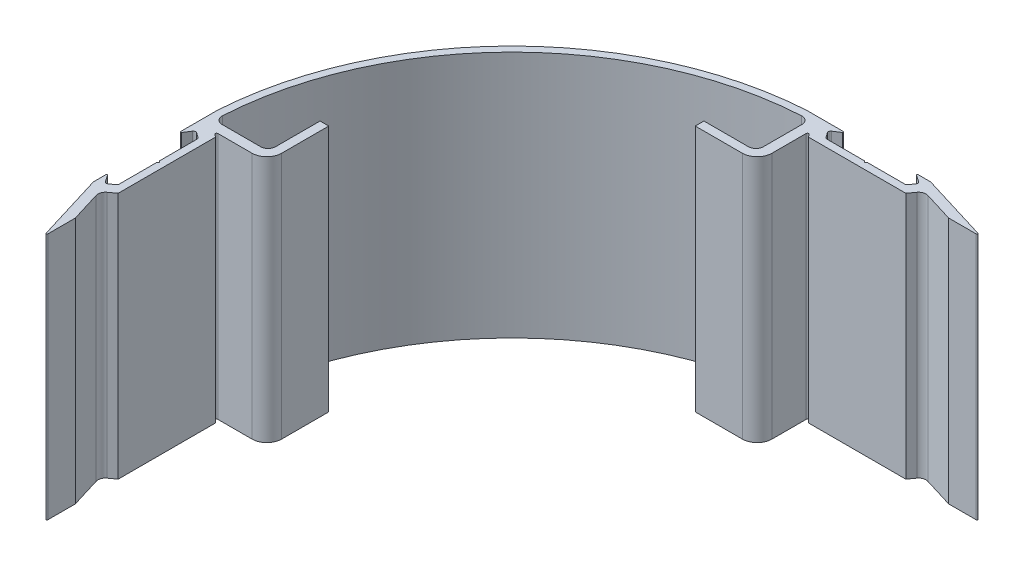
ISO-10303-21;
HEADER;
FILE_DESCRIPTION(('STEP AP214'),'2;1');
FILE_NAME('part.step','',(''),(''),'','','');
FILE_SCHEMA(('AUTOMOTIVE_DESIGN { 1 0 10303 214 1 1 1 1 }'));
ENDSEC;
DATA;
#1=APPLICATION_CONTEXT('core data for automotive mechanical design processes');
#2=APPLICATION_PROTOCOL_DEFINITION('international standard','automotive_design',2000,#1);
#3=PRODUCT_CONTEXT('',#1,'mechanical');
#4=PRODUCT('Part','Part','',(#3));
#5=PRODUCT_RELATED_PRODUCT_CATEGORY('part','',(#4));
#6=PRODUCT_DEFINITION_FORMATION('','',#4);
#7=PRODUCT_DEFINITION_CONTEXT('part definition',#1,'design');
#8=PRODUCT_DEFINITION('design','',#6,#7);
#9=PRODUCT_DEFINITION_SHAPE('','',#8);
#10=(LENGTH_UNIT() NAMED_UNIT(*) SI_UNIT(.MILLI.,.METRE.));
#11=(NAMED_UNIT(*) PLANE_ANGLE_UNIT() SI_UNIT($,.RADIAN.));
#12=(NAMED_UNIT(*) SI_UNIT($,.STERADIAN.) SOLID_ANGLE_UNIT());
#13=UNCERTAINTY_MEASURE_WITH_UNIT(LENGTH_MEASURE(1.E-05),#10,'distance_accuracy_value','');
#14=(GEOMETRIC_REPRESENTATION_CONTEXT(3) GLOBAL_UNCERTAINTY_ASSIGNED_CONTEXT((#13)) GLOBAL_UNIT_ASSIGNED_CONTEXT((#10,
#11,#12)) REPRESENTATION_CONTEXT('',''));
#15=CARTESIAN_POINT('',(0.,0.,0.));
#16=DIRECTION('',(0.,0.,1.));
#17=DIRECTION('',(1.,0.,0.));
#18=AXIS2_PLACEMENT_3D('',#15,#16,#17);
#19=CARTESIAN_POINT('',(-121.027466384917,50.,-6.97043683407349));
#20=DIRECTION('',(0.,-1.,0.));
#21=DIRECTION('',(0.,0.,-1.));
#22=AXIS2_PLACEMENT_3D('',#19,#20,#21);
#23=CYLINDRICAL_SURFACE('',#22,2.99999999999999);
#24=CARTESIAN_POINT('',(-121.027466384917,-50.,-6.97043683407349));
#25=DIRECTION('',(0.,-1.,0.));
#26=DIRECTION('',(0.,0.,1.));
#27=AXIS2_PLACEMENT_3D('',#24,#25,#26);
#28=CIRCLE('',#27,2.99999999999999);
#29=CARTESIAN_POINT('',(-121.027466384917,-50.,-3.9704368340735));
#30=VERTEX_POINT('',#29);
#31=CARTESIAN_POINT('',(-124.022503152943,-50.,-7.14293250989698));
#32=VERTEX_POINT('',#31);
#33=EDGE_CURVE('E488',#30,#32,#28,.T.);
#34=ORIENTED_EDGE('',*,*,#33,.T.);
#35=DIRECTION('',(0.,-1.,0.));
#36=VECTOR('',#35,1.);
#37=CARTESIAN_POINT('',(-124.022503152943,50.,-7.14293250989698));
#38=LINE('',#37,#36);
#39=CARTESIAN_POINT('',(-124.022503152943,50.,-7.14293250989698));
#40=VERTEX_POINT('',#39);
#41=EDGE_CURVE('E11',#40,#32,#38,.T.);
#42=ORIENTED_EDGE('',*,*,#41,.F.);
#43=CARTESIAN_POINT('',(-121.027466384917,50.,-6.97043683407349));
#44=DIRECTION('',(0.,-1.,0.));
#45=DIRECTION('',(0.,0.,1.));
#46=AXIS2_PLACEMENT_3D('',#43,#44,#45);
#47=CIRCLE('',#46,2.99999999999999);
#48=CARTESIAN_POINT('',(-121.027466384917,50.,-3.9704368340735));
#49=VERTEX_POINT('',#48);
#50=EDGE_CURVE('E623',#49,#40,#47,.T.);
#51=ORIENTED_EDGE('',*,*,#50,.F.);
#52=DIRECTION('',(0.,-1.,0.));
#53=VECTOR('',#52,1.);
#54=CARTESIAN_POINT('',(-121.027466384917,50.,-3.9704368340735));
#55=LINE('',#54,#53);
#56=EDGE_CURVE('E484',#49,#30,#55,.T.);
#57=ORIENTED_EDGE('',*,*,#56,.T.);
#58=EDGE_LOOP('',(#34,#42,#51,#57));
#59=FACE_BOUND('',#58,.T.);
#60=ADVANCED_FACE('F32',(#59),#23,.F.);
#61=CARTESIAN_POINT('',(0.,50.,0.));
#62=DIRECTION('',(0.,-1.,0.));
#63=DIRECTION('',(0.,0.,-1.));
#64=AXIS2_PLACEMENT_3D('',#61,#62,#63);
#65=CYLINDRICAL_SURFACE('',#64,124.22802732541);
#66=CARTESIAN_POINT('',(0.,-50.,0.));
#67=DIRECTION('',(0.,-1.,0.));
#68=DIRECTION('',(0.,0.,1.));
#69=AXIS2_PLACEMENT_3D('',#66,#67,#68);
#70=CIRCLE('',#69,124.22802732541);
#71=CARTESIAN_POINT('',(-7.14293250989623,-50.,-124.022503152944));
#72=VERTEX_POINT('',#71);
#73=EDGE_CURVE('E491',#32,#72,#70,.T.);
#74=ORIENTED_EDGE('',*,*,#73,.T.);
#75=DIRECTION('',(0.,-1.,0.));
#76=VECTOR('',#75,1.);
#77=CARTESIAN_POINT('',(-7.14293250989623,50.,-124.022503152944));
#78=LINE('',#77,#76);
#79=CARTESIAN_POINT('',(-7.14293250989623,50.,-124.022503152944));
#80=VERTEX_POINT('',#79);
#81=EDGE_CURVE('E40',#80,#72,#78,.T.);
#82=ORIENTED_EDGE('',*,*,#81,.F.);
#83=CARTESIAN_POINT('',(0.,50.,0.));
#84=DIRECTION('',(0.,-1.,0.));
#85=DIRECTION('',(0.,0.,1.));
#86=AXIS2_PLACEMENT_3D('',#83,#84,#85);
#87=CIRCLE('',#86,124.22802732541);
#88=EDGE_CURVE('E271',#40,#80,#87,.T.);
#89=ORIENTED_EDGE('',*,*,#88,.F.);
#90=ORIENTED_EDGE('',*,*,#41,.T.);
#91=EDGE_LOOP('',(#74,#82,#89,#90));
#92=FACE_BOUND('',#91,.T.);
#93=ADVANCED_FACE('F981',(#92),#65,.F.);
#94=CARTESIAN_POINT('',(-6.9704368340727,50.,-121.027466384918));
#95=DIRECTION('',(0.,-1.,0.));
#96=DIRECTION('',(0.,0.,-1.));
#97=AXIS2_PLACEMENT_3D('',#94,#95,#96);
#98=CYLINDRICAL_SURFACE('',#97,3.00000000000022);
#99=CARTESIAN_POINT('',(-6.9704368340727,-50.,-121.027466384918));
#100=DIRECTION('',(0.,-1.,0.));
#101=DIRECTION('',(0.,0.,1.));
#102=AXIS2_PLACEMENT_3D('',#99,#100,#101);
#103=CIRCLE('',#102,3.00000000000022);
#104=CARTESIAN_POINT('',(-3.97043683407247,-50.,-121.027466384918));
#105=VERTEX_POINT('',#104);
#106=EDGE_CURVE('E493',#72,#105,#103,.T.);
#107=ORIENTED_EDGE('',*,*,#106,.T.);
#108=DIRECTION('',(0.,-1.,0.));
#109=VECTOR('',#108,1.);
#110=CARTESIAN_POINT('',(-3.97043683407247,50.,-121.027466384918));
#111=LINE('',#110,#109);
#112=CARTESIAN_POINT('',(-3.97043683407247,50.,-121.027466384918));
#113=VERTEX_POINT('',#112);
#114=EDGE_CURVE('E810',#113,#105,#111,.T.);
#115=ORIENTED_EDGE('',*,*,#114,.F.);
#116=CARTESIAN_POINT('',(-6.9704368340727,50.,-121.027466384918));
#117=DIRECTION('',(0.,-1.,0.));
#118=DIRECTION('',(0.,0.,1.));
#119=AXIS2_PLACEMENT_3D('',#116,#117,#118);
#120=CIRCLE('',#119,3.00000000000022);
#121=EDGE_CURVE('E818',#80,#113,#120,.T.);
#122=ORIENTED_EDGE('',*,*,#121,.F.);
#123=ORIENTED_EDGE('',*,*,#81,.T.);
#124=EDGE_LOOP('',(#107,#115,#122,#123));
#125=FACE_BOUND('',#124,.T.);
#126=ADVANCED_FACE('F816',(#125),#98,.F.);
#127=CARTESIAN_POINT('',(-3.9704368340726,50.,-105.479999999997));
#128=DIRECTION('',(1.,0.,0.));
#129=DIRECTION('',(0.,0.,-1.));
#130=AXIS2_PLACEMENT_3D('',#127,#128,#129);
#131=PLANE('',#130);
#132=DIRECTION('',(0.,0.,1.));
#133=VECTOR('',#132,1.);
#134=CARTESIAN_POINT('',(-3.9704368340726,-50.,-105.479999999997));
#135=LINE('',#134,#133);
#136=CARTESIAN_POINT('',(-3.9704368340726,-50.,-105.479999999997));
#137=VERTEX_POINT('',#136);
#138=EDGE_CURVE('E495',#105,#137,#135,.T.);
#139=ORIENTED_EDGE('',*,*,#138,.T.);
#140=DIRECTION('',(0.,-1.,0.));
#141=VECTOR('',#140,1.);
#142=CARTESIAN_POINT('',(-3.9704368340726,50.,-105.479999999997));
#143=LINE('',#142,#141);
#144=CARTESIAN_POINT('',(-3.9704368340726,50.,-105.479999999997));
#145=VERTEX_POINT('',#144);
#146=EDGE_CURVE('E807',#145,#137,#143,.T.);
#147=ORIENTED_EDGE('',*,*,#146,.F.);
#148=DIRECTION('',(0.,0.,1.));
#149=VECTOR('',#148,1.);
#150=CARTESIAN_POINT('',(-3.9704368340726,50.,-105.479999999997));
#151=LINE('',#150,#149);
#152=EDGE_CURVE('E836',#113,#145,#151,.T.);
#153=ORIENTED_EDGE('',*,*,#152,.F.);
#154=ORIENTED_EDGE('',*,*,#114,.T.);
#155=EDGE_LOOP('',(#139,#147,#153,#154));
#156=FACE_BOUND('',#155,.T.);
#157=ADVANCED_FACE('F827',(#156),#131,.F.);
#158=CARTESIAN_POINT('',(-6.9704368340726,50.,-105.479999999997));
#159=DIRECTION('',(0.,-1.,0.));
#160=DIRECTION('',(0.,0.,-1.));
#161=AXIS2_PLACEMENT_3D('',#158,#159,#160);
#162=CYLINDRICAL_SURFACE('',#161,3.);
#163=CARTESIAN_POINT('',(-6.9704368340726,-50.,-105.479999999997));
#164=DIRECTION('',(0.,-1.,0.));
#165=DIRECTION('',(0.,0.,1.));
#166=AXIS2_PLACEMENT_3D('',#163,#164,#165);
#167=CIRCLE('',#166,3.);
#168=CARTESIAN_POINT('',(-6.97043683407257,-50.,-102.479999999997));
#169=VERTEX_POINT('',#168);
#170=EDGE_CURVE('E497',#137,#169,#167,.T.);
#171=ORIENTED_EDGE('',*,*,#170,.T.);
#172=DIRECTION('',(0.,-1.,0.));
#173=VECTOR('',#172,1.);
#174=CARTESIAN_POINT('',(-6.97043683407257,50.,-102.479999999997));
#175=LINE('',#174,#173);
#176=CARTESIAN_POINT('',(-6.97043683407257,50.,-102.479999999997));
#177=VERTEX_POINT('',#176);
#178=EDGE_CURVE('E804',#177,#169,#175,.T.);
#179=ORIENTED_EDGE('',*,*,#178,.F.);
#180=CARTESIAN_POINT('',(-6.9704368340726,50.,-105.479999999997));
#181=DIRECTION('',(0.,-1.,0.));
#182=DIRECTION('',(0.,0.,1.));
#183=AXIS2_PLACEMENT_3D('',#180,#181,#182);
#184=CIRCLE('',#183,3.);
#185=EDGE_CURVE('E833',#145,#177,#184,.T.);
#186=ORIENTED_EDGE('',*,*,#185,.F.);
#187=ORIENTED_EDGE('',*,*,#146,.T.);
#188=EDGE_LOOP('',(#171,#179,#186,#187));
#189=FACE_BOUND('',#188,.T.);
#190=ADVANCED_FACE('F831',(#189),#162,.F.);
#191=CARTESIAN_POINT('',(-24.9704368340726,50.,-102.479999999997));
#192=DIRECTION('',(0.,0.,1.));
#193=DIRECTION('',(1.,0.,0.));
#194=AXIS2_PLACEMENT_3D('',#191,#192,#193);
#195=PLANE('',#194);
#196=DIRECTION('',(-1.,0.,0.));
#197=VECTOR('',#196,1.);
#198=CARTESIAN_POINT('',(-24.9704368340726,-50.,-102.479999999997));
#199=LINE('',#198,#197);
#200=CARTESIAN_POINT('',(-24.9704368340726,-50.,-102.479999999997));
#201=VERTEX_POINT('',#200);
#202=EDGE_CURVE('E499',#169,#201,#199,.T.);
#203=ORIENTED_EDGE('',*,*,#202,.T.);
#204=DIRECTION('',(0.,-1.,0.));
#205=VECTOR('',#204,1.);
#206=CARTESIAN_POINT('',(-24.9704368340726,50.,-102.479999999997));
#207=LINE('',#206,#205);
#208=CARTESIAN_POINT('',(-24.9704368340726,50.,-102.479999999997));
#209=VERTEX_POINT('',#208);
#210=EDGE_CURVE('E801',#209,#201,#207,.T.);
#211=ORIENTED_EDGE('',*,*,#210,.F.);
#212=DIRECTION('',(-1.,0.,0.));
#213=VECTOR('',#212,1.);
#214=CARTESIAN_POINT('',(-24.9704368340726,50.,-102.479999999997));
#215=LINE('',#214,#213);
#216=EDGE_CURVE('E835',#177,#209,#215,.T.);
#217=ORIENTED_EDGE('',*,*,#216,.F.);
#218=ORIENTED_EDGE('',*,*,#178,.T.);
#219=EDGE_LOOP('',(#203,#211,#217,#218));
#220=FACE_BOUND('',#219,.T.);
#221=ADVANCED_FACE('F994',(#220),#195,.F.);
#222=CARTESIAN_POINT('',(-24.9704368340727,50.,-98.9799999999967));
#223=DIRECTION('',(1.,0.,0.));
#224=DIRECTION('',(0.,0.,-1.));
#225=AXIS2_PLACEMENT_3D('',#222,#223,#224);
#226=PLANE('',#225);
#227=DIRECTION('',(0.,0.,1.));
#228=VECTOR('',#227,1.);
#229=CARTESIAN_POINT('',(-24.9704368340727,-50.,-98.9799999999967));
#230=LINE('',#229,#228);
#231=CARTESIAN_POINT('',(-24.9704368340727,-50.,-98.9799999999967));
#232=VERTEX_POINT('',#231);
#233=EDGE_CURVE('E501',#201,#232,#230,.T.);
#234=ORIENTED_EDGE('',*,*,#233,.T.);
#235=DIRECTION('',(0.,-1.,0.));
#236=VECTOR('',#235,1.);
#237=CARTESIAN_POINT('',(-24.9704368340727,50.,-98.9799999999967));
#238=LINE('',#237,#236);
#239=CARTESIAN_POINT('',(-24.9704368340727,50.,-98.9799999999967));
#240=VERTEX_POINT('',#239);
#241=EDGE_CURVE('E798',#240,#232,#238,.T.);
#242=ORIENTED_EDGE('',*,*,#241,.F.);
#243=DIRECTION('',(0.,0.,1.));
#244=VECTOR('',#243,1.);
#245=CARTESIAN_POINT('',(-24.9704368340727,50.,-98.9799999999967));
#246=LINE('',#245,#244);
#247=EDGE_CURVE('E838',#209,#240,#246,.T.);
#248=ORIENTED_EDGE('',*,*,#247,.F.);
#249=ORIENTED_EDGE('',*,*,#210,.T.);
#250=EDGE_LOOP('',(#234,#242,#248,#249));
#251=FACE_BOUND('',#250,.T.);
#252=ADVANCED_FACE('F997',(#251),#226,.F.);
#253=CARTESIAN_POINT('',(-5.97043683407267,50.,-98.9799999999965));
#254=DIRECTION('',(0.,0.,-1.));
#255=DIRECTION('',(-1.,0.,0.));
#256=AXIS2_PLACEMENT_3D('',#253,#254,#255);
#257=PLANE('',#256);
#258=DIRECTION('',(1.,0.,0.));
#259=VECTOR('',#258,1.);
#260=CARTESIAN_POINT('',(-5.97043683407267,-50.,-98.9799999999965));
#261=LINE('',#260,#259);
#262=CARTESIAN_POINT('',(-5.97043683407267,-50.,-98.9799999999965));
#263=VERTEX_POINT('',#262);
#264=EDGE_CURVE('E503',#232,#263,#261,.T.);
#265=ORIENTED_EDGE('',*,*,#264,.T.);
#266=DIRECTION('',(0.,-1.,0.));
#267=VECTOR('',#266,1.);
#268=CARTESIAN_POINT('',(-5.97043683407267,50.,-98.9799999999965));
#269=LINE('',#268,#267);
#270=CARTESIAN_POINT('',(-5.97043683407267,50.,-98.9799999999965));
#271=VERTEX_POINT('',#270);
#272=EDGE_CURVE('E795',#271,#263,#269,.T.);
#273=ORIENTED_EDGE('',*,*,#272,.F.);
#274=DIRECTION('',(1.,0.,0.));
#275=VECTOR('',#274,1.);
#276=CARTESIAN_POINT('',(-5.97043683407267,50.,-98.9799999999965));
#277=LINE('',#276,#275);
#278=EDGE_CURVE('E844',#240,#271,#277,.T.);
#279=ORIENTED_EDGE('',*,*,#278,.F.);
#280=ORIENTED_EDGE('',*,*,#241,.T.);
#281=EDGE_LOOP('',(#265,#273,#279,#280));
#282=FACE_BOUND('',#281,.T.);
#283=ADVANCED_FACE('F1001',(#282),#257,.F.);
#284=CARTESIAN_POINT('',(-5.97043683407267,50.,-104.979999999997));
#285=DIRECTION('',(0.,-1.,0.));
#286=DIRECTION('',(0.,0.,-1.));
#287=AXIS2_PLACEMENT_3D('',#284,#285,#286);
#288=CYLINDRICAL_SURFACE('',#287,6.00000000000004);
#289=CARTESIAN_POINT('',(-5.97043683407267,-50.,-104.979999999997));
#290=DIRECTION('',(0.,1.,0.));
#291=DIRECTION('',(0.,0.,1.));
#292=AXIS2_PLACEMENT_3D('',#289,#290,#291);
#293=CIRCLE('',#292,6.00000000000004);
#294=CARTESIAN_POINT('',(0.0295631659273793,-50.,-104.979999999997));
#295=VERTEX_POINT('',#294);
#296=EDGE_CURVE('E505',#263,#295,#293,.T.);
#297=ORIENTED_EDGE('',*,*,#296,.T.);
#298=DIRECTION('',(0.,-1.,0.));
#299=VECTOR('',#298,1.);
#300=CARTESIAN_POINT('',(0.0295631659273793,50.,-104.979999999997));
#301=LINE('',#300,#299);
#302=CARTESIAN_POINT('',(0.0295631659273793,50.,-104.979999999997));
#303=VERTEX_POINT('',#302);
#304=EDGE_CURVE('E792',#303,#295,#301,.T.);
#305=ORIENTED_EDGE('',*,*,#304,.F.);
#306=CARTESIAN_POINT('',(-5.97043683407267,50.,-104.979999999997));
#307=DIRECTION('',(0.,1.,0.));
#308=DIRECTION('',(0.,0.,1.));
#309=AXIS2_PLACEMENT_3D('',#306,#307,#308);
#310=CIRCLE('',#309,6.00000000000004);
#311=EDGE_CURVE('E846',#271,#303,#310,.T.);
#312=ORIENTED_EDGE('',*,*,#311,.F.);
#313=ORIENTED_EDGE('',*,*,#272,.T.);
#314=EDGE_LOOP('',(#297,#305,#312,#313));
#315=FACE_BOUND('',#314,.T.);
#316=ADVANCED_FACE('F1005',(#315),#288,.T.);
#317=CARTESIAN_POINT('',(0.0295631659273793,50.,-104.979999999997));
#318=DIRECTION('',(-1.,0.,0.));
#319=DIRECTION('',(0.,0.,1.));
#320=AXIS2_PLACEMENT_3D('',#317,#318,#319);
#321=PLANE('',#320);
#322=DIRECTION('',(0.,0.,-1.));
#323=VECTOR('',#322,1.);
#324=CARTESIAN_POINT('',(0.0295631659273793,-50.,-104.979999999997));
#325=LINE('',#324,#323);
#326=CARTESIAN_POINT('',(0.029563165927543,-50.,-118.743663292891));
#327=VERTEX_POINT('',#326);
#328=EDGE_CURVE('E507',#295,#327,#325,.T.);
#329=ORIENTED_EDGE('',*,*,#328,.T.);
#330=DIRECTION('',(0.,-1.,0.));
#331=VECTOR('',#330,1.);
#332=CARTESIAN_POINT('',(0.029563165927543,50.,-118.743663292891));
#333=LINE('',#332,#331);
#334=CARTESIAN_POINT('',(0.029563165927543,50.,-118.743663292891));
#335=VERTEX_POINT('',#334);
#336=EDGE_CURVE('E789',#335,#327,#333,.T.);
#337=ORIENTED_EDGE('',*,*,#336,.F.);
#338=DIRECTION('',(0.,0.,-1.));
#339=VECTOR('',#338,1.);
#340=CARTESIAN_POINT('',(0.0295631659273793,50.,-104.979999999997));
#341=LINE('',#340,#339);
#342=EDGE_CURVE('E848',#303,#335,#341,.T.);
#343=ORIENTED_EDGE('',*,*,#342,.F.);
#344=ORIENTED_EDGE('',*,*,#304,.T.);
#345=EDGE_LOOP('',(#329,#337,#343,#344));
#346=FACE_BOUND('',#345,.T.);
#347=ADVANCED_FACE('F1009',(#346),#321,.F.);
#348=CARTESIAN_POINT('',(0.54589987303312,50.,-118.743663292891));
#349=DIRECTION('',(0.,-1.,0.));
#350=DIRECTION('',(0.,0.,-1.));
#351=AXIS2_PLACEMENT_3D('',#348,#349,#350);
#352=CYLINDRICAL_SURFACE('',#351,0.516336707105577);
#353=CARTESIAN_POINT('',(0.54589987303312,-50.,-118.743663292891));
#354=DIRECTION('',(0.,-1.,0.));
#355=DIRECTION('',(0.,0.,1.));
#356=AXIS2_PLACEMENT_3D('',#353,#354,#355);
#357=CIRCLE('',#356,0.516336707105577);
#358=CARTESIAN_POINT('',(0.963625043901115,-50.,-119.047158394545));
#359=VERTEX_POINT('',#358);
#360=EDGE_CURVE('E509',#327,#359,#357,.T.);
#361=ORIENTED_EDGE('',*,*,#360,.T.);
#362=DIRECTION('',(0.,-1.,0.));
#363=VECTOR('',#362,1.);
#364=CARTESIAN_POINT('',(0.963625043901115,50.,-119.047158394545));
#365=LINE('',#364,#363);
#366=CARTESIAN_POINT('',(0.963625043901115,50.,-119.047158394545));
#367=VERTEX_POINT('',#366);
#368=EDGE_CURVE('E786',#367,#359,#365,.T.);
#369=ORIENTED_EDGE('',*,*,#368,.F.);
#370=CARTESIAN_POINT('',(0.54589987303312,50.,-118.743663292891));
#371=DIRECTION('',(0.,-1.,0.));
#372=DIRECTION('',(0.,0.,1.));
#373=AXIS2_PLACEMENT_3D('',#370,#371,#372);
#374=CIRCLE('',#373,0.516336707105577);
#375=EDGE_CURVE('E850',#335,#367,#374,.T.);
#376=ORIENTED_EDGE('',*,*,#375,.F.);
#377=ORIENTED_EDGE('',*,*,#336,.T.);
#378=EDGE_LOOP('',(#361,#369,#376,#377));
#379=FACE_BOUND('',#378,.T.);
#380=ADVANCED_FACE('F1013',(#379),#352,.F.);
#381=CARTESIAN_POINT('',(1.73896100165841,50.,-117.979999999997));
#382=DIRECTION('',(0.809016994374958,0.,-0.587785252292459));
#383=DIRECTION('',(-0.587785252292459,0.,-0.809016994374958));
#384=AXIS2_PLACEMENT_3D('',#381,#382,#383);
#385=PLANE('',#384);
#386=DIRECTION('',(0.587785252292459,0.,0.809016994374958));
#387=VECTOR('',#386,1.);
#388=CARTESIAN_POINT('',(1.73896100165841,-50.,-117.979999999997));
#389=LINE('',#388,#387);
#390=CARTESIAN_POINT('',(1.73896100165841,-50.,-117.979999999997));
#391=VERTEX_POINT('',#390);
#392=EDGE_CURVE('E511',#359,#391,#389,.T.);
#393=ORIENTED_EDGE('',*,*,#392,.T.);
#394=DIRECTION('',(0.,-1.,0.));
#395=VECTOR('',#394,1.);
#396=CARTESIAN_POINT('',(1.73896100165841,50.,-117.979999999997));
#397=LINE('',#396,#395);
#398=CARTESIAN_POINT('',(1.73896100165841,50.,-117.979999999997));
#399=VERTEX_POINT('',#398);
#400=EDGE_CURVE('E783',#399,#391,#397,.T.);
#401=ORIENTED_EDGE('',*,*,#400,.F.);
#402=DIRECTION('',(0.587785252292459,0.,0.809016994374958));
#403=VECTOR('',#402,1.);
#404=CARTESIAN_POINT('',(1.73896100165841,50.,-117.979999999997));
#405=LINE('',#404,#403);
#406=EDGE_CURVE('E852',#367,#399,#405,.T.);
#407=ORIENTED_EDGE('',*,*,#406,.F.);
#408=ORIENTED_EDGE('',*,*,#368,.T.);
#409=EDGE_LOOP('',(#393,#401,#407,#408));
#410=FACE_BOUND('',#409,.T.);
#411=ADVANCED_FACE('F1017',(#410),#385,.F.);
#412=CARTESIAN_POINT('',(41.0650064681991,50.,-117.979999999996));
#413=DIRECTION('',(0.,0.,-1.));
#414=DIRECTION('',(-1.,0.,0.));
#415=AXIS2_PLACEMENT_3D('',#412,#413,#414);
#416=PLANE('',#415);
#417=DIRECTION('',(1.,0.,0.));
#418=VECTOR('',#417,1.);
#419=CARTESIAN_POINT('',(41.0650064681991,-50.,-117.979999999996));
#420=LINE('',#419,#418);
#421=CARTESIAN_POINT('',(41.0650064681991,-50.,-117.979999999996));
#422=VERTEX_POINT('',#421);
#423=EDGE_CURVE('E514',#391,#422,#420,.T.);
#424=ORIENTED_EDGE('',*,*,#423,.T.);
#425=DIRECTION('',(0.,-1.,0.));
#426=VECTOR('',#425,1.);
#427=CARTESIAN_POINT('',(41.0650064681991,50.,-117.979999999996));
#428=LINE('',#427,#426);
#429=CARTESIAN_POINT('',(41.0650064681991,50.,-117.979999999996));
#430=VERTEX_POINT('',#429);
#431=EDGE_CURVE('E780',#430,#422,#428,.T.);
#432=ORIENTED_EDGE('',*,*,#431,.F.);
#433=DIRECTION('',(1.,0.,0.));
#434=VECTOR('',#433,1.);
#435=CARTESIAN_POINT('',(21.9396733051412,50.,-117.979999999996));
#436=LINE('',#435,#434);
#437=EDGE_CURVE('E854',#399,#430,#436,.T.);
#438=ORIENTED_EDGE('',*,*,#437,.F.);
#439=ORIENTED_EDGE('',*,*,#400,.T.);
#440=EDGE_LOOP('',(#424,#432,#438,#439));
#441=FACE_BOUND('',#440,.T.);
#442=ADVANCED_FACE('F1021',(#441),#416,.F.);
#443=CARTESIAN_POINT('',(42.9535136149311,50.,-120.579307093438));
#444=DIRECTION('',(-0.809016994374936,0.,-0.587785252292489));
#445=DIRECTION('',(-0.587785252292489,0.,0.809016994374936));
#446=AXIS2_PLACEMENT_3D('',#443,#444,#445);
#447=PLANE('',#446);
#448=DIRECTION('',(0.587785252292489,0.,-0.809016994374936));
#449=VECTOR('',#448,1.);
#450=CARTESIAN_POINT('',(42.9535136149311,-50.,-120.579307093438));
#451=LINE('',#450,#449);
#452=CARTESIAN_POINT('',(42.9535136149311,-50.,-120.579307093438));
#453=VERTEX_POINT('',#452);
#454=EDGE_CURVE('E516',#422,#453,#451,.T.);
#455=ORIENTED_EDGE('',*,*,#454,.T.);
#456=DIRECTION('',(0.,-1.,0.));
#457=VECTOR('',#456,1.);
#458=CARTESIAN_POINT('',(42.9535136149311,50.,-120.579307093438));
#459=LINE('',#458,#457);
#460=CARTESIAN_POINT('',(42.9535136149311,50.,-120.579307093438));
#461=VERTEX_POINT('',#460);
#462=EDGE_CURVE('E777',#461,#453,#459,.T.);
#463=ORIENTED_EDGE('',*,*,#462,.F.);
#464=DIRECTION('',(0.587785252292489,0.,-0.809016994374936));
#465=VECTOR('',#464,1.);
#466=CARTESIAN_POINT('',(42.9535136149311,50.,-120.579307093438));
#467=LINE('',#466,#465);
#468=EDGE_CURVE('E856',#430,#461,#467,.T.);
#469=ORIENTED_EDGE('',*,*,#468,.F.);
#470=ORIENTED_EDGE('',*,*,#431,.T.);
#471=EDGE_LOOP('',(#455,#463,#469,#470));
#472=FACE_BOUND('',#471,.T.);
#473=ADVANCED_FACE('F1025',(#472),#447,.F.);
#474=CARTESIAN_POINT('',(45.3805645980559,50.,-118.815951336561));
#475=DIRECTION('',(0.,-1.,0.));
#476=DIRECTION('',(0.,0.,-1.));
#477=AXIS2_PLACEMENT_3D('',#474,#475,#476);
#478=CYLINDRICAL_SURFACE('',#477,3.00000000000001);
#479=CARTESIAN_POINT('',(45.3805645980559,-50.,-118.815951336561));
#480=DIRECTION('',(0.,-1.,0.));
#481=DIRECTION('',(0.,0.,1.));
#482=AXIS2_PLACEMENT_3D('',#479,#480,#481);
#483=CIRCLE('',#482,3.00000000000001);
#484=CARTESIAN_POINT('',(46.2576797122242,-50.,-121.68486560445));
#485=VERTEX_POINT('',#484);
#486=EDGE_CURVE('E518',#453,#485,#483,.T.);
#487=ORIENTED_EDGE('',*,*,#486,.T.);
#488=DIRECTION('',(0.,-1.,0.));
#489=VECTOR('',#488,1.);
#490=CARTESIAN_POINT('',(46.2576797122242,50.,-121.68486560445));
#491=LINE('',#490,#489);
#492=CARTESIAN_POINT('',(46.2576797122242,50.,-121.68486560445));
#493=VERTEX_POINT('',#492);
#494=EDGE_CURVE('E774',#493,#485,#491,.T.);
#495=ORIENTED_EDGE('',*,*,#494,.F.);
#496=CARTESIAN_POINT('',(45.3805645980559,50.,-118.815951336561));
#497=DIRECTION('',(0.,-1.,0.));
#498=DIRECTION('',(0.,0.,1.));
#499=AXIS2_PLACEMENT_3D('',#496,#497,#498);
#500=CIRCLE('',#499,3.00000000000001);
#501=EDGE_CURVE('E858',#461,#493,#500,.T.);
#502=ORIENTED_EDGE('',*,*,#501,.F.);
#503=ORIENTED_EDGE('',*,*,#462,.T.);
#504=EDGE_LOOP('',(#487,#495,#502,#503));
#505=FACE_BOUND('',#504,.T.);
#506=ADVANCED_FACE('F1029',(#505),#478,.F.);
#507=CARTESIAN_POINT('',(58.3757490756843,50.,-117.979999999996));
#508=DIRECTION('',(0.292371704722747,0.,-0.956304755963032));
#509=DIRECTION('',(-0.956304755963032,0.,-0.292371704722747));
#510=AXIS2_PLACEMENT_3D('',#507,#508,#509);
#511=PLANE('',#510);
#512=DIRECTION('',(0.956304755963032,0.,0.292371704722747));
#513=VECTOR('',#512,1.);
#514=CARTESIAN_POINT('',(58.3757490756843,-50.,-117.979999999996));
#515=LINE('',#514,#513);
#516=CARTESIAN_POINT('',(58.3757490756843,-50.,-117.979999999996));
#517=VERTEX_POINT('',#516);
#518=EDGE_CURVE('E520',#485,#517,#515,.T.);
#519=ORIENTED_EDGE('',*,*,#518,.T.);
#520=DIRECTION('',(0.,-1.,0.));
#521=VECTOR('',#520,1.);
#522=CARTESIAN_POINT('',(58.3757490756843,50.,-117.979999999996));
#523=LINE('',#522,#521);
#524=CARTESIAN_POINT('',(58.3757490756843,50.,-117.979999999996));
#525=VERTEX_POINT('',#524);
#526=EDGE_CURVE('E771',#525,#517,#523,.T.);
#527=ORIENTED_EDGE('',*,*,#526,.F.);
#528=DIRECTION('',(0.956304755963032,0.,0.292371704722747));
#529=VECTOR('',#528,1.);
#530=CARTESIAN_POINT('',(58.3757490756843,50.,-117.979999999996));
#531=LINE('',#530,#529);
#532=EDGE_CURVE('E860',#493,#525,#531,.T.);
#533=ORIENTED_EDGE('',*,*,#532,.F.);
#534=ORIENTED_EDGE('',*,*,#494,.T.);
#535=EDGE_LOOP('',(#519,#527,#533,#534));
#536=FACE_BOUND('',#535,.T.);
#537=ADVANCED_FACE('F1033',(#536),#511,.F.);
#538=CARTESIAN_POINT('',(69.5000000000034,50.,-117.979999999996));
#539=DIRECTION('',(0.,0.,-1.));
#540=DIRECTION('',(-1.,0.,0.));
#541=AXIS2_PLACEMENT_3D('',#538,#539,#540);
#542=PLANE('',#541);
#543=DIRECTION('',(1.,0.,0.));
#544=VECTOR('',#543,1.);
#545=CARTESIAN_POINT('',(69.5000000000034,-50.,-117.979999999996));
#546=LINE('',#545,#544);
#547=CARTESIAN_POINT('',(69.5000000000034,-50.,-117.979999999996));
#548=VERTEX_POINT('',#547);
#549=EDGE_CURVE('E522',#517,#548,#546,.T.);
#550=ORIENTED_EDGE('',*,*,#549,.T.);
#551=DIRECTION('',(0.,-1.,0.));
#552=VECTOR('',#551,1.);
#553=CARTESIAN_POINT('',(69.5000000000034,50.,-117.979999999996));
#554=LINE('',#553,#552);
#555=CARTESIAN_POINT('',(69.5000000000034,50.,-117.979999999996));
#556=VERTEX_POINT('',#555);
#557=EDGE_CURVE('E768',#556,#548,#554,.T.);
#558=ORIENTED_EDGE('',*,*,#557,.F.);
#559=DIRECTION('',(1.,0.,0.));
#560=VECTOR('',#559,1.);
#561=CARTESIAN_POINT('',(69.5000000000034,50.,-117.979999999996));
#562=LINE('',#561,#560);
#563=EDGE_CURVE('E862',#525,#556,#562,.T.);
#564=ORIENTED_EDGE('',*,*,#563,.F.);
#565=ORIENTED_EDGE('',*,*,#526,.T.);
#566=EDGE_LOOP('',(#550,#558,#564,#565));
#567=FACE_BOUND('',#566,.T.);
#568=ADVANCED_FACE('F1037',(#567),#542,.F.);
#569=CARTESIAN_POINT('',(69.5000000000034,50.,-118.279999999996));
#570=DIRECTION('',(0.,-1.,0.));
#571=DIRECTION('',(0.,0.,-1.));
#572=AXIS2_PLACEMENT_3D('',#569,#570,#571);
#573=CYLINDRICAL_SURFACE('',#572,0.299999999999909);
#574=CARTESIAN_POINT('',(69.5000000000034,-50.,-118.279999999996));
#575=DIRECTION('',(0.,1.,0.));
#576=DIRECTION('',(0.,0.,1.));
#577=AXIS2_PLACEMENT_3D('',#574,#575,#576);
#578=CIRCLE('',#577,0.299999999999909);
#579=CARTESIAN_POINT('',(69.58771151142,-50.,-118.566891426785));
#580=VERTEX_POINT('',#579);
#581=EDGE_CURVE('E524',#548,#580,#578,.T.);
#582=ORIENTED_EDGE('',*,*,#581,.T.);
#583=DIRECTION('',(0.,-1.,0.));
#584=VECTOR('',#583,1.);
#585=CARTESIAN_POINT('',(69.58771151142,50.,-118.566891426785));
#586=LINE('',#585,#584);
#587=CARTESIAN_POINT('',(69.58771151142,50.,-118.566891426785));
#588=VERTEX_POINT('',#587);
#589=EDGE_CURVE('E765',#588,#580,#586,.T.);
#590=ORIENTED_EDGE('',*,*,#589,.F.);
#591=CARTESIAN_POINT('',(69.5000000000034,50.,-118.279999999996));
#592=DIRECTION('',(0.,1.,0.));
#593=DIRECTION('',(0.,0.,1.));
#594=AXIS2_PLACEMENT_3D('',#591,#592,#593);
#595=CIRCLE('',#594,0.299999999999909);
#596=EDGE_CURVE('E864',#556,#588,#595,.T.);
#597=ORIENTED_EDGE('',*,*,#596,.F.);
#598=ORIENTED_EDGE('',*,*,#557,.T.);
#599=EDGE_LOOP('',(#582,#590,#597,#598));
#600=FACE_BOUND('',#599,.T.);
#601=ADVANCED_FACE('F1041',(#600),#573,.T.);
#602=CARTESIAN_POINT('',(42.0696733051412,50.,-126.979999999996));
#603=DIRECTION('',(-0.292371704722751,0.,0.956304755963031));
#604=DIRECTION('',(0.956304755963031,0.,0.292371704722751));
#605=AXIS2_PLACEMENT_3D('',#602,#603,#604);
#606=PLANE('',#605);
#607=DIRECTION('',(-0.956304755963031,0.,-0.292371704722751));
#608=VECTOR('',#607,1.);
#609=CARTESIAN_POINT('',(42.0696733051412,-50.,-126.979999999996));
#610=LINE('',#609,#608);
#611=CARTESIAN_POINT('',(42.0696733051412,-50.,-126.979999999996));
#612=VERTEX_POINT('',#611);
#613=EDGE_CURVE('E526',#580,#612,#610,.T.);
#614=ORIENTED_EDGE('',*,*,#613,.T.);
#615=DIRECTION('',(0.,-1.,0.));
#616=VECTOR('',#615,1.);
#617=CARTESIAN_POINT('',(42.0696733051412,50.,-126.979999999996));
#618=LINE('',#617,#616);
#619=CARTESIAN_POINT('',(42.0696733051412,50.,-126.979999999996));
#620=VERTEX_POINT('',#619);
#621=EDGE_CURVE('E762',#620,#612,#618,.T.);
#622=ORIENTED_EDGE('',*,*,#621,.F.);
#623=DIRECTION('',(-0.956304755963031,0.,-0.292371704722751));
#624=VECTOR('',#623,1.);
#625=CARTESIAN_POINT('',(42.0696733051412,50.,-126.979999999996));
#626=LINE('',#625,#624);
#627=EDGE_CURVE('E866',#588,#620,#626,.T.);
#628=ORIENTED_EDGE('',*,*,#627,.F.);
#629=ORIENTED_EDGE('',*,*,#589,.T.);
#630=EDGE_LOOP('',(#614,#622,#628,#629));
#631=FACE_BOUND('',#630,.T.);
#632=ADVANCED_FACE('F1045',(#631),#606,.F.);
#633=CARTESIAN_POINT('',(37.0496405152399,50.,-126.979999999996));
#634=DIRECTION('',(0.,0.,1.));
#635=DIRECTION('',(1.,0.,0.));
#636=AXIS2_PLACEMENT_3D('',#633,#634,#635);
#637=PLANE('',#636);
#638=DIRECTION('',(-1.,0.,0.));
#639=VECTOR('',#638,1.);
#640=CARTESIAN_POINT('',(37.0496405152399,-50.,-126.979999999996));
#641=LINE('',#640,#639);
#642=CARTESIAN_POINT('',(37.0496405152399,-50.,-126.979999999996));
#643=VERTEX_POINT('',#642);
#644=EDGE_CURVE('E528',#612,#643,#641,.T.);
#645=ORIENTED_EDGE('',*,*,#644,.T.);
#646=DIRECTION('',(0.,-1.,0.));
#647=VECTOR('',#646,1.);
#648=CARTESIAN_POINT('',(37.0496405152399,50.,-126.979999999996));
#649=LINE('',#648,#647);
#650=CARTESIAN_POINT('',(37.0496405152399,50.,-126.979999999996));
#651=VERTEX_POINT('',#650);
#652=EDGE_CURVE('E759',#651,#643,#649,.T.);
#653=ORIENTED_EDGE('',*,*,#652,.F.);
#654=DIRECTION('',(-1.,0.,0.));
#655=VECTOR('',#654,1.);
#656=CARTESIAN_POINT('',(37.0496405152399,50.,-126.979999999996));
#657=LINE('',#656,#655);
#658=EDGE_CURVE('E868',#620,#651,#657,.T.);
#659=ORIENTED_EDGE('',*,*,#658,.F.);
#660=ORIENTED_EDGE('',*,*,#621,.T.);
#661=EDGE_LOOP('',(#645,#653,#659,#660));
#662=FACE_BOUND('',#661,.T.);
#663=ADVANCED_FACE('F1049',(#662),#637,.F.);
#664=CARTESIAN_POINT('',(37.0496405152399,50.,-126.679999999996));
#665=DIRECTION('',(0.,-1.,0.));
#666=DIRECTION('',(0.,0.,-1.));
#667=AXIS2_PLACEMENT_3D('',#664,#665,#666);
#668=CYLINDRICAL_SURFACE('',#667,0.299999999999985);
#669=CARTESIAN_POINT('',(37.0496405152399,-50.,-126.679999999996));
#670=DIRECTION('',(0.,1.,0.));
#671=DIRECTION('',(0.,0.,1.));
#672=AXIS2_PLACEMENT_3D('',#669,#670,#671);
#673=CIRCLE('',#672,0.299999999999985);
#674=CARTESIAN_POINT('',(36.8862488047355,-50.,-126.428398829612));
#675=VERTEX_POINT('',#674);
#676=EDGE_CURVE('E530',#643,#675,#673,.T.);
#677=ORIENTED_EDGE('',*,*,#676,.T.);
#678=DIRECTION('',(0.,-1.,0.));
#679=VECTOR('',#678,1.);
#680=CARTESIAN_POINT('',(36.8862488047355,50.,-126.428398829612));
#681=LINE('',#680,#679);
#682=CARTESIAN_POINT('',(36.8862488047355,50.,-126.428398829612));
#683=VERTEX_POINT('',#682);
#684=EDGE_CURVE('E756',#683,#675,#681,.T.);
#685=ORIENTED_EDGE('',*,*,#684,.F.);
#686=CARTESIAN_POINT('',(37.0496405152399,50.,-126.679999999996));
#687=DIRECTION('',(0.,1.,0.));
#688=DIRECTION('',(0.,0.,1.));
#689=AXIS2_PLACEMENT_3D('',#686,#687,#688);
#690=CIRCLE('',#689,0.299999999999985);
#691=EDGE_CURVE('E870',#651,#683,#690,.T.);
#692=ORIENTED_EDGE('',*,*,#691,.F.);
#693=ORIENTED_EDGE('',*,*,#652,.T.);
#694=EDGE_LOOP('',(#677,#685,#692,#693));
#695=FACE_BOUND('',#694,.T.);
#696=ADVANCED_FACE('F1053',(#695),#668,.T.);
#697=CARTESIAN_POINT('',(39.5436072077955,50.,-124.702690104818));
#698=DIRECTION('',(0.544639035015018,0.,-0.83867056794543));
#699=DIRECTION('',(-0.83867056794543,0.,-0.544639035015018));
#700=AXIS2_PLACEMENT_3D('',#697,#698,#699);
#701=PLANE('',#700);
#702=DIRECTION('',(0.83867056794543,0.,0.544639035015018));
#703=VECTOR('',#702,1.);
#704=CARTESIAN_POINT('',(39.5436072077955,-50.,-124.702690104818));
#705=LINE('',#704,#703);
#706=CARTESIAN_POINT('',(39.5436072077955,-50.,-124.702690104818));
#707=VERTEX_POINT('',#706);
#708=EDGE_CURVE('E532',#675,#707,#705,.T.);
#709=ORIENTED_EDGE('',*,*,#708,.T.);
#710=DIRECTION('',(0.,-1.,0.));
#711=VECTOR('',#710,1.);
#712=CARTESIAN_POINT('',(39.5436072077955,50.,-124.702690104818));
#713=LINE('',#712,#711);
#714=CARTESIAN_POINT('',(39.5436072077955,50.,-124.702690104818));
#715=VERTEX_POINT('',#714);
#716=EDGE_CURVE('E753',#715,#707,#713,.T.);
#717=ORIENTED_EDGE('',*,*,#716,.F.);
#718=DIRECTION('',(0.83867056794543,0.,0.544639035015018));
#719=VECTOR('',#718,1.);
#720=CARTESIAN_POINT('',(39.5436072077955,50.,-124.702690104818));
#721=LINE('',#720,#719);
#722=EDGE_CURVE('E872',#683,#715,#721,.T.);
#723=ORIENTED_EDGE('',*,*,#722,.F.);
#724=ORIENTED_EDGE('',*,*,#684,.T.);
#725=EDGE_LOOP('',(#709,#717,#723,#724));
#726=FACE_BOUND('',#725,.T.);
#727=ADVANCED_FACE('F1057',(#726),#701,.F.);
#728=CARTESIAN_POINT('',(38.9989681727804,50.,-123.864019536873));
#729=DIRECTION('',(0.,-1.,0.));
#730=DIRECTION('',(0.,0.,-1.));
#731=AXIS2_PLACEMENT_3D('',#728,#729,#730);
#732=CYLINDRICAL_SURFACE('',#731,1.00000000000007);
#733=CARTESIAN_POINT('',(38.9989681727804,-50.,-123.864019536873));
#734=DIRECTION('',(0.,-1.,0.));
#735=DIRECTION('',(0.,0.,1.));
#736=AXIS2_PLACEMENT_3D('',#733,#734,#735);
#737=CIRCLE('',#736,1.00000000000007);
#738=CARTESIAN_POINT('',(39.8079851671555,-50.,-123.27623428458));
#739=VERTEX_POINT('',#738);
#740=EDGE_CURVE('E534',#707,#739,#737,.T.);
#741=ORIENTED_EDGE('',*,*,#740,.T.);
#742=DIRECTION('',(0.,-1.,0.));
#743=VECTOR('',#742,1.);
#744=CARTESIAN_POINT('',(39.8079851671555,50.,-123.27623428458));
#745=LINE('',#744,#743);
#746=CARTESIAN_POINT('',(39.8079851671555,50.,-123.27623428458));
#747=VERTEX_POINT('',#746);
#748=EDGE_CURVE('E750',#747,#739,#745,.T.);
#749=ORIENTED_EDGE('',*,*,#748,.F.);
#750=CARTESIAN_POINT('',(38.9989681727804,50.,-123.864019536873));
#751=DIRECTION('',(0.,-1.,0.));
#752=DIRECTION('',(0.,0.,1.));
#753=AXIS2_PLACEMENT_3D('',#750,#751,#752);
#754=CIRCLE('',#753,1.00000000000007);
#755=EDGE_CURVE('E874',#715,#747,#754,.T.);
#756=ORIENTED_EDGE('',*,*,#755,.F.);
#757=ORIENTED_EDGE('',*,*,#716,.T.);
#758=EDGE_LOOP('',(#741,#749,#756,#757));
#759=FACE_BOUND('',#758,.T.);
#760=ADVANCED_FACE('F1061',(#759),#732,.F.);
#761=CARTESIAN_POINT('',(38.4391648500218,50.,-121.392214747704));
#762=DIRECTION('',(0.80901699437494,0.,0.587785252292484));
#763=DIRECTION('',(0.587785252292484,0.,-0.80901699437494));
#764=AXIS2_PLACEMENT_3D('',#761,#762,#763);
#765=PLANE('',#764);
#766=DIRECTION('',(-0.587785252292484,0.,0.80901699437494));
#767=VECTOR('',#766,1.);
#768=CARTESIAN_POINT('',(38.4391648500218,-50.,-121.392214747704));
#769=LINE('',#768,#767);
#770=CARTESIAN_POINT('',(38.4391648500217,-50.,-121.392214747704));
#771=VERTEX_POINT('',#770);
#772=EDGE_CURVE('E536',#739,#771,#769,.T.);
#773=ORIENTED_EDGE('',*,*,#772,.T.);
#774=DIRECTION('',(0.,-1.,0.));
#775=VECTOR('',#774,1.);
#776=CARTESIAN_POINT('',(38.4391648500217,50.,-121.392214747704));
#777=LINE('',#776,#775);
#778=CARTESIAN_POINT('',(38.4391648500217,50.,-121.392214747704));
#779=VERTEX_POINT('',#778);
#780=EDGE_CURVE('E747',#779,#771,#777,.T.);
#781=ORIENTED_EDGE('',*,*,#780,.F.);
#782=DIRECTION('',(-0.587785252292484,0.,0.80901699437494));
#783=VECTOR('',#782,1.);
#784=CARTESIAN_POINT('',(38.4391648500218,50.,-121.392214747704));
#785=LINE('',#784,#783);
#786=EDGE_CURVE('E876',#747,#779,#785,.T.);
#787=ORIENTED_EDGE('',*,*,#786,.F.);
#788=ORIENTED_EDGE('',*,*,#748,.T.);
#789=EDGE_LOOP('',(#773,#781,#787,#788));
#790=FACE_BOUND('',#789,.T.);
#791=ADVANCED_FACE('F1065',(#790),#765,.F.);
#792=CARTESIAN_POINT('',(37.6301478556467,50.,-121.979999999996));
#793=DIRECTION('',(0.,-1.,0.));
#794=DIRECTION('',(0.,0.,-1.));
#795=AXIS2_PLACEMENT_3D('',#792,#793,#794);
#796=CYLINDRICAL_SURFACE('',#795,0.999999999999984);
#797=CARTESIAN_POINT('',(37.6301478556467,-50.,-121.979999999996));
#798=DIRECTION('',(0.,-1.,0.));
#799=DIRECTION('',(0.,0.,1.));
#800=AXIS2_PLACEMENT_3D('',#797,#798,#799);
#801=CIRCLE('',#800,0.999999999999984);
#802=CARTESIAN_POINT('',(37.6301478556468,-50.,-120.979999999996));
#803=VERTEX_POINT('',#802);
#804=EDGE_CURVE('E538',#771,#803,#801,.T.);
#805=ORIENTED_EDGE('',*,*,#804,.T.);
#806=DIRECTION('',(0.,-1.,0.));
#807=VECTOR('',#806,1.);
#808=CARTESIAN_POINT('',(37.6301478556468,50.,-120.979999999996));
#809=LINE('',#808,#807);
#810=CARTESIAN_POINT('',(37.6301478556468,50.,-120.979999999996));
#811=VERTEX_POINT('',#810);
#812=EDGE_CURVE('E744',#811,#803,#809,.T.);
#813=ORIENTED_EDGE('',*,*,#812,.F.);
#814=CARTESIAN_POINT('',(37.6301478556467,50.,-121.979999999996));
#815=DIRECTION('',(0.,-1.,0.));
#816=DIRECTION('',(0.,0.,1.));
#817=AXIS2_PLACEMENT_3D('',#814,#815,#816);
#818=CIRCLE('',#817,0.999999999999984);
#819=EDGE_CURVE('E878',#779,#811,#818,.T.);
#820=ORIENTED_EDGE('',*,*,#819,.F.);
#821=ORIENTED_EDGE('',*,*,#780,.T.);
#822=EDGE_LOOP('',(#805,#813,#820,#821));
#823=FACE_BOUND('',#822,.T.);
#824=ADVANCED_FACE('F1069',(#823),#796,.F.);
#825=CARTESIAN_POINT('',(22.4396733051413,50.,-120.979999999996));
#826=DIRECTION('',(0.,0.,1.));
#827=DIRECTION('',(1.,0.,0.));
#828=AXIS2_PLACEMENT_3D('',#825,#826,#827);
#829=PLANE('',#828);
#830=DIRECTION('',(-1.,0.,0.));
#831=VECTOR('',#830,1.);
#832=CARTESIAN_POINT('',(22.4396733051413,-50.,-120.979999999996));
#833=LINE('',#832,#831);
#834=CARTESIAN_POINT('',(22.4396733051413,-50.,-120.979999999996));
#835=VERTEX_POINT('',#834);
#836=EDGE_CURVE('E540',#803,#835,#833,.T.);
#837=ORIENTED_EDGE('',*,*,#836,.T.);
#838=DIRECTION('',(0.,-1.,0.));
#839=VECTOR('',#838,1.);
#840=CARTESIAN_POINT('',(22.4396733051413,50.,-120.979999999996));
#841=LINE('',#840,#839);
#842=CARTESIAN_POINT('',(22.4396733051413,50.,-120.979999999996));
#843=VERTEX_POINT('',#842);
#844=EDGE_CURVE('E741',#843,#835,#841,.T.);
#845=ORIENTED_EDGE('',*,*,#844,.F.);
#846=DIRECTION('',(-1.,0.,0.));
#847=VECTOR('',#846,1.);
#848=CARTESIAN_POINT('',(22.4396733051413,50.,-120.979999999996));
#849=LINE('',#848,#847);
#850=EDGE_CURVE('E880',#811,#843,#849,.T.);
#851=ORIENTED_EDGE('',*,*,#850,.F.);
#852=ORIENTED_EDGE('',*,*,#812,.T.);
#853=EDGE_LOOP('',(#837,#845,#851,#852));
#854=FACE_BOUND('',#853,.T.);
#855=ADVANCED_FACE('F1073',(#854),#829,.F.);
#856=CARTESIAN_POINT('',(21.9396733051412,50.,-120.479999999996));
#857=DIRECTION('',(0.70710678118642,0.,0.707106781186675));
#858=DIRECTION('',(0.707106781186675,0.,-0.70710678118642));
#859=AXIS2_PLACEMENT_3D('',#856,#857,#858);
#860=PLANE('',#859);
#861=DIRECTION('',(-0.707106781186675,0.,0.70710678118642));
#862=VECTOR('',#861,1.);
#863=CARTESIAN_POINT('',(21.9396733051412,-50.,-120.479999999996));
#864=LINE('',#863,#862);
#865=CARTESIAN_POINT('',(21.9396733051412,-50.,-120.479999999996));
#866=VERTEX_POINT('',#865);
#867=EDGE_CURVE('E542',#835,#866,#864,.T.);
#868=ORIENTED_EDGE('',*,*,#867,.T.);
#869=DIRECTION('',(0.,-1.,0.));
#870=VECTOR('',#869,1.);
#871=CARTESIAN_POINT('',(21.9396733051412,50.,-120.479999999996));
#872=LINE('',#871,#870);
#873=CARTESIAN_POINT('',(21.9396733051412,50.,-120.479999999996));
#874=VERTEX_POINT('',#873);
#875=EDGE_CURVE('E738',#874,#866,#872,.T.);
#876=ORIENTED_EDGE('',*,*,#875,.F.);
#877=DIRECTION('',(-0.707106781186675,0.,0.70710678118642));
#878=VECTOR('',#877,1.);
#879=CARTESIAN_POINT('',(21.9396733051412,50.,-120.479999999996));
#880=LINE('',#879,#878);
#881=EDGE_CURVE('E882',#843,#874,#880,.T.);
#882=ORIENTED_EDGE('',*,*,#881,.F.);
#883=ORIENTED_EDGE('',*,*,#844,.T.);
#884=EDGE_LOOP('',(#868,#876,#882,#883));
#885=FACE_BOUND('',#884,.T.);
#886=ADVANCED_FACE('F1077',(#885),#860,.F.);
#887=CARTESIAN_POINT('',(21.4396733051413,50.,-120.979999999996));
#888=DIRECTION('',(-0.707106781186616,0.,0.707106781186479));
#889=DIRECTION('',(0.707106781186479,0.,0.707106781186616));
#890=AXIS2_PLACEMENT_3D('',#887,#888,#889);
#891=PLANE('',#890);
#892=DIRECTION('',(-0.707106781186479,0.,-0.707106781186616));
#893=VECTOR('',#892,1.);
#894=CARTESIAN_POINT('',(21.4396733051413,-50.,-120.979999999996));
#895=LINE('',#894,#893);
#896=CARTESIAN_POINT('',(21.4396733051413,-50.,-120.979999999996));
#897=VERTEX_POINT('',#896);
#898=EDGE_CURVE('E544',#866,#897,#895,.T.);
#899=ORIENTED_EDGE('',*,*,#898,.T.);
#900=DIRECTION('',(0.,-1.,0.));
#901=VECTOR('',#900,1.);
#902=CARTESIAN_POINT('',(21.4396733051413,50.,-120.979999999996));
#903=LINE('',#902,#901);
#904=CARTESIAN_POINT('',(21.4396733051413,50.,-120.979999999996));
#905=VERTEX_POINT('',#904);
#906=EDGE_CURVE('E735',#905,#897,#903,.T.);
#907=ORIENTED_EDGE('',*,*,#906,.F.);
#908=DIRECTION('',(-0.707106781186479,0.,-0.707106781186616));
#909=VECTOR('',#908,1.);
#910=CARTESIAN_POINT('',(21.4396733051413,50.,-120.979999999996));
#911=LINE('',#910,#909);
#912=EDGE_CURVE('E884',#874,#905,#911,.T.);
#913=ORIENTED_EDGE('',*,*,#912,.F.);
#914=ORIENTED_EDGE('',*,*,#875,.T.);
#915=EDGE_LOOP('',(#899,#907,#913,#914));
#916=FACE_BOUND('',#915,.T.);
#917=ADVANCED_FACE('F1081',(#916),#891,.F.);
#918=CARTESIAN_POINT('',(6.24919875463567,50.,-120.979999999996));
#919=DIRECTION('',(0.,0.,1.));
#920=DIRECTION('',(1.,0.,0.));
#921=AXIS2_PLACEMENT_3D('',#918,#919,#920);
#922=PLANE('',#921);
#923=DIRECTION('',(-1.,0.,0.));
#924=VECTOR('',#923,1.);
#925=CARTESIAN_POINT('',(6.24919875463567,-50.,-120.979999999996));
#926=LINE('',#925,#924);
#927=CARTESIAN_POINT('',(6.24919875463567,-50.,-120.979999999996));
#928=VERTEX_POINT('',#927);
#929=EDGE_CURVE('E546',#897,#928,#926,.T.);
#930=ORIENTED_EDGE('',*,*,#929,.T.);
#931=DIRECTION('',(0.,-1.,0.));
#932=VECTOR('',#931,1.);
#933=CARTESIAN_POINT('',(6.24919875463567,50.,-120.979999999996));
#934=LINE('',#933,#932);
#935=CARTESIAN_POINT('',(6.24919875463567,50.,-120.979999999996));
#936=VERTEX_POINT('',#935);
#937=EDGE_CURVE('E732',#936,#928,#934,.T.);
#938=ORIENTED_EDGE('',*,*,#937,.F.);
#939=DIRECTION('',(-1.,0.,0.));
#940=VECTOR('',#939,1.);
#941=CARTESIAN_POINT('',(6.24919875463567,50.,-120.979999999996));
#942=LINE('',#941,#940);
#943=EDGE_CURVE('E886',#905,#936,#942,.T.);
#944=ORIENTED_EDGE('',*,*,#943,.F.);
#945=ORIENTED_EDGE('',*,*,#906,.T.);
#946=EDGE_LOOP('',(#930,#938,#944,#945));
#947=FACE_BOUND('',#946,.T.);
#948=ADVANCED_FACE('F1085',(#947),#922,.F.);
#949=CARTESIAN_POINT('',(6.24919875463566,50.,-121.979999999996));
#950=DIRECTION('',(0.,-1.,0.));
#951=DIRECTION('',(0.,0.,-1.));
#952=AXIS2_PLACEMENT_3D('',#949,#950,#951);
#953=CYLINDRICAL_SURFACE('',#952,1.);
#954=CARTESIAN_POINT('',(6.24919875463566,-50.,-121.979999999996));
#955=DIRECTION('',(0.,-1.,0.));
#956=DIRECTION('',(0.,0.,1.));
#957=AXIS2_PLACEMENT_3D('',#954,#955,#956);
#958=CIRCLE('',#957,1.);
#959=CARTESIAN_POINT('',(5.44018176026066,-50.,-121.392214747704));
#960=VERTEX_POINT('',#959);
#961=EDGE_CURVE('E548',#928,#960,#958,.T.);
#962=ORIENTED_EDGE('',*,*,#961,.T.);
#963=DIRECTION('',(0.,-1.,0.));
#964=VECTOR('',#963,1.);
#965=CARTESIAN_POINT('',(5.44018176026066,50.,-121.392214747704));
#966=LINE('',#965,#964);
#967=CARTESIAN_POINT('',(5.44018176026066,50.,-121.392214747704));
#968=VERTEX_POINT('',#967);
#969=EDGE_CURVE('E729',#968,#960,#966,.T.);
#970=ORIENTED_EDGE('',*,*,#969,.F.);
#971=CARTESIAN_POINT('',(6.24919875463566,50.,-121.979999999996));
#972=DIRECTION('',(0.,-1.,0.));
#973=DIRECTION('',(0.,0.,1.));
#974=AXIS2_PLACEMENT_3D('',#971,#972,#973);
#975=CIRCLE('',#974,1.);
#976=EDGE_CURVE('E888',#936,#968,#975,.T.);
#977=ORIENTED_EDGE('',*,*,#976,.F.);
#978=ORIENTED_EDGE('',*,*,#937,.T.);
#979=EDGE_LOOP('',(#962,#970,#977,#978));
#980=FACE_BOUND('',#979,.T.);
#981=ADVANCED_FACE('F1089',(#980),#953,.F.);
#982=CARTESIAN_POINT('',(4.07136144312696,50.,-123.27623428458));
#983=DIRECTION('',(-0.80901699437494,0.,0.587785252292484));
#984=DIRECTION('',(0.587785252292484,0.,0.80901699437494));
#985=AXIS2_PLACEMENT_3D('',#982,#983,#984);
#986=PLANE('',#985);
#987=DIRECTION('',(-0.587785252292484,0.,-0.80901699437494));
#988=VECTOR('',#987,1.);
#989=CARTESIAN_POINT('',(4.07136144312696,-50.,-123.27623428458));
#990=LINE('',#989,#988);
#991=CARTESIAN_POINT('',(4.07136144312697,-50.,-123.27623428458));
#992=VERTEX_POINT('',#991);
#993=EDGE_CURVE('E550',#960,#992,#990,.T.);
#994=ORIENTED_EDGE('',*,*,#993,.T.);
#995=DIRECTION('',(0.,-1.,0.));
#996=VECTOR('',#995,1.);
#997=CARTESIAN_POINT('',(4.07136144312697,50.,-123.27623428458));
#998=LINE('',#997,#996);
#999=CARTESIAN_POINT('',(4.07136144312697,50.,-123.27623428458));
#1000=VERTEX_POINT('',#999);
#1001=EDGE_CURVE('E726',#1000,#992,#998,.T.);
#1002=ORIENTED_EDGE('',*,*,#1001,.F.);
#1003=DIRECTION('',(-0.587785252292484,0.,-0.80901699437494));
#1004=VECTOR('',#1003,1.);
#1005=CARTESIAN_POINT('',(4.07136144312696,50.,-123.27623428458));
#1006=LINE('',#1005,#1004);
#1007=EDGE_CURVE('E890',#968,#1000,#1006,.T.);
#1008=ORIENTED_EDGE('',*,*,#1007,.F.);
#1009=ORIENTED_EDGE('',*,*,#969,.T.);
#1010=EDGE_LOOP('',(#994,#1002,#1008,#1009));
#1011=FACE_BOUND('',#1010,.T.);
#1012=ADVANCED_FACE('F1093',(#1011),#986,.F.);
#1013=CARTESIAN_POINT('',(4.88037843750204,50.,-123.864019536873));
#1014=DIRECTION('',(0.,-1.,0.));
#1015=DIRECTION('',(0.,0.,-1.));
#1016=AXIS2_PLACEMENT_3D('',#1013,#1014,#1015);
#1017=CYLINDRICAL_SURFACE('',#1016,1.00000000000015);
#1018=CARTESIAN_POINT('',(4.88037843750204,-50.,-123.864019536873));
#1019=DIRECTION('',(0.,-1.,0.));
#1020=DIRECTION('',(0.,0.,1.));
#1021=AXIS2_PLACEMENT_3D('',#1018,#1019,#1020);
#1022=CIRCLE('',#1021,1.00000000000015);
#1023=CARTESIAN_POINT('',(4.33573940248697,-50.,-124.702690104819));
#1024=VERTEX_POINT('',#1023);
#1025=EDGE_CURVE('E552',#992,#1024,#1022,.T.);
#1026=ORIENTED_EDGE('',*,*,#1025,.T.);
#1027=DIRECTION('',(0.,-1.,0.));
#1028=VECTOR('',#1027,1.);
#1029=CARTESIAN_POINT('',(4.33573940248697,50.,-124.702690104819));
#1030=LINE('',#1029,#1028);
#1031=CARTESIAN_POINT('',(4.33573940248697,50.,-124.702690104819));
#1032=VERTEX_POINT('',#1031);
#1033=EDGE_CURVE('E723',#1032,#1024,#1030,.T.);
#1034=ORIENTED_EDGE('',*,*,#1033,.F.);
#1035=CARTESIAN_POINT('',(4.88037843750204,50.,-123.864019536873));
#1036=DIRECTION('',(0.,-1.,0.));
#1037=DIRECTION('',(0.,0.,1.));
#1038=AXIS2_PLACEMENT_3D('',#1035,#1036,#1037);
#1039=CIRCLE('',#1038,1.00000000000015);
#1040=EDGE_CURVE('E892',#1000,#1032,#1039,.T.);
#1041=ORIENTED_EDGE('',*,*,#1040,.F.);
#1042=ORIENTED_EDGE('',*,*,#1001,.T.);
#1043=EDGE_LOOP('',(#1026,#1034,#1041,#1042));
#1044=FACE_BOUND('',#1043,.T.);
#1045=ADVANCED_FACE('F1097',(#1044),#1017,.F.);
#1046=CARTESIAN_POINT('',(4.33573940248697,50.,-124.702690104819));
#1047=DIRECTION('',(-0.544639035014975,0.,-0.838670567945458));
#1048=DIRECTION('',(-0.838670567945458,0.,0.544639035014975));
#1049=AXIS2_PLACEMENT_3D('',#1046,#1047,#1048);
#1050=PLANE('',#1049);
#1051=DIRECTION('',(0.838670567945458,0.,-0.544639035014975));
#1052=VECTOR('',#1051,1.);
#1053=CARTESIAN_POINT('',(4.33573940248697,-50.,-124.702690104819));
#1054=LINE('',#1053,#1052);
#1055=CARTESIAN_POINT('',(6.99309780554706,-50.,-126.428398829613));
#1056=VERTEX_POINT('',#1055);
#1057=EDGE_CURVE('E554',#1024,#1056,#1054,.T.);
#1058=ORIENTED_EDGE('',*,*,#1057,.T.);
#1059=DIRECTION('',(0.,-1.,0.));
#1060=VECTOR('',#1059,1.);
#1061=CARTESIAN_POINT('',(6.99309780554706,50.,-126.428398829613));
#1062=LINE('',#1061,#1060);
#1063=CARTESIAN_POINT('',(6.99309780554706,50.,-126.428398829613));
#1064=VERTEX_POINT('',#1063);
#1065=EDGE_CURVE('E720',#1064,#1056,#1062,.T.);
#1066=ORIENTED_EDGE('',*,*,#1065,.F.);
#1067=DIRECTION('',(0.838670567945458,0.,-0.544639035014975));
#1068=VECTOR('',#1067,1.);
#1069=CARTESIAN_POINT('',(4.33573940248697,50.,-124.702690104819));
#1070=LINE('',#1069,#1068);
#1071=EDGE_CURVE('E894',#1032,#1064,#1070,.T.);
#1072=ORIENTED_EDGE('',*,*,#1071,.F.);
#1073=ORIENTED_EDGE('',*,*,#1033,.T.);
#1074=EDGE_LOOP('',(#1058,#1066,#1072,#1073));
#1075=FACE_BOUND('',#1074,.T.);
#1076=ADVANCED_FACE('F1101',(#1075),#1050,.F.);
#1077=CARTESIAN_POINT('',(6.82970609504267,50.,-126.679999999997));
#1078=DIRECTION('',(0.,-1.,0.));
#1079=DIRECTION('',(0.,0.,-1.));
#1080=AXIS2_PLACEMENT_3D('',#1077,#1078,#1079);
#1081=CYLINDRICAL_SURFACE('',#1080,0.300000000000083);
#1082=CARTESIAN_POINT('',(6.82970609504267,-50.,-126.679999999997));
#1083=DIRECTION('',(0.,1.,0.));
#1084=DIRECTION('',(0.,0.,1.));
#1085=AXIS2_PLACEMENT_3D('',#1082,#1083,#1084);
#1086=CIRCLE('',#1085,0.300000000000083);
#1087=CARTESIAN_POINT('',(6.82970609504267,-50.,-126.979999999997));
#1088=VERTEX_POINT('',#1087);
#1089=EDGE_CURVE('E556',#1056,#1088,#1086,.T.);
#1090=ORIENTED_EDGE('',*,*,#1089,.T.);
#1091=DIRECTION('',(0.,-1.,0.));
#1092=VECTOR('',#1091,1.);
#1093=CARTESIAN_POINT('',(6.82970609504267,50.,-126.979999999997));
#1094=LINE('',#1093,#1092);
#1095=CARTESIAN_POINT('',(6.82970609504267,50.,-126.979999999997));
#1096=VERTEX_POINT('',#1095);
#1097=EDGE_CURVE('E717',#1096,#1088,#1094,.T.);
#1098=ORIENTED_EDGE('',*,*,#1097,.F.);
#1099=CARTESIAN_POINT('',(6.82970609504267,50.,-126.679999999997));
#1100=DIRECTION('',(0.,1.,0.));
#1101=DIRECTION('',(0.,0.,1.));
#1102=AXIS2_PLACEMENT_3D('',#1099,#1100,#1101);
#1103=CIRCLE('',#1102,0.300000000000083);
#1104=EDGE_CURVE('E896',#1064,#1096,#1103,.T.);
#1105=ORIENTED_EDGE('',*,*,#1104,.F.);
#1106=ORIENTED_EDGE('',*,*,#1065,.T.);
#1107=EDGE_LOOP('',(#1090,#1098,#1105,#1106));
#1108=FACE_BOUND('',#1107,.T.);
#1109=ADVANCED_FACE('F1105',(#1108),#1081,.T.);
#1110=CARTESIAN_POINT('',(-7.94043683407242,50.,-126.979999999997));
#1111=DIRECTION('',(0.,0.,1.));
#1112=DIRECTION('',(1.,0.,0.));
#1113=AXIS2_PLACEMENT_3D('',#1110,#1111,#1112);
#1114=PLANE('',#1113);
#1115=DIRECTION('',(-1.,0.,0.));
#1116=VECTOR('',#1115,1.);
#1117=CARTESIAN_POINT('',(-7.94043683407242,-50.,-126.979999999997));
#1118=LINE('',#1117,#1116);
#1119=CARTESIAN_POINT('',(-7.94043683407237,-50.,-126.979999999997));
#1120=VERTEX_POINT('',#1119);
#1121=EDGE_CURVE('E558',#1088,#1120,#1118,.T.);
#1122=ORIENTED_EDGE('',*,*,#1121,.T.);
#1123=DIRECTION('',(0.,-1.,0.));
#1124=VECTOR('',#1123,1.);
#1125=CARTESIAN_POINT('',(-7.94043683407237,50.,-126.979999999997));
#1126=LINE('',#1125,#1124);
#1127=CARTESIAN_POINT('',(-7.94043683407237,50.,-126.979999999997));
#1128=VERTEX_POINT('',#1127);
#1129=EDGE_CURVE('E714',#1128,#1120,#1126,.T.);
#1130=ORIENTED_EDGE('',*,*,#1129,.F.);
#1131=DIRECTION('',(-1.,0.,0.));
#1132=VECTOR('',#1131,1.);
#1133=CARTESIAN_POINT('',(-7.94043683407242,50.,-126.979999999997));
#1134=LINE('',#1133,#1132);
#1135=EDGE_CURVE('E898',#1096,#1128,#1134,.T.);
#1136=ORIENTED_EDGE('',*,*,#1135,.F.);
#1137=ORIENTED_EDGE('',*,*,#1097,.T.);
#1138=EDGE_LOOP('',(#1122,#1130,#1136,#1137));
#1139=FACE_BOUND('',#1138,.T.);
#1140=ADVANCED_FACE('F1109',(#1139),#1114,.F.);
#1141=CARTESIAN_POINT('',(0.,50.,0.));
#1142=DIRECTION('',(0.,-1.,0.));
#1143=DIRECTION('',(0.,0.,-1.));
#1144=AXIS2_PLACEMENT_3D('',#1141,#1142,#1143);
#1145=CYLINDRICAL_SURFACE('',#1144,127.228027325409);
#1146=CARTESIAN_POINT('',(0.,-50.,0.));
#1147=DIRECTION('',(0.,1.,0.));
#1148=DIRECTION('',(0.,0.,1.));
#1149=AXIS2_PLACEMENT_3D('',#1146,#1147,#1148);
#1150=CIRCLE('',#1149,127.228027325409);
#1151=CARTESIAN_POINT('',(-126.979999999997,-50.,-7.94043683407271));
#1152=VERTEX_POINT('',#1151);
#1153=EDGE_CURVE('E560',#1120,#1152,#1150,.T.);
#1154=ORIENTED_EDGE('',*,*,#1153,.T.);
#1155=DIRECTION('',(0.,-1.,0.));
#1156=VECTOR('',#1155,1.);
#1157=CARTESIAN_POINT('',(-126.979999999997,50.,-7.94043683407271));
#1158=LINE('',#1157,#1156);
#1159=CARTESIAN_POINT('',(-126.979999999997,50.,-7.94043683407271));
#1160=VERTEX_POINT('',#1159);
#1161=EDGE_CURVE('E711',#1160,#1152,#1158,.T.);
#1162=ORIENTED_EDGE('',*,*,#1161,.F.);
#1163=CARTESIAN_POINT('',(0.,50.,0.));
#1164=DIRECTION('',(0.,1.,0.));
#1165=DIRECTION('',(0.,0.,1.));
#1166=AXIS2_PLACEMENT_3D('',#1163,#1164,#1165);
#1167=CIRCLE('',#1166,127.228027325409);
#1168=EDGE_CURVE('E900',#1128,#1160,#1167,.T.);
#1169=ORIENTED_EDGE('',*,*,#1168,.F.);
#1170=ORIENTED_EDGE('',*,*,#1129,.T.);
#1171=EDGE_LOOP('',(#1154,#1162,#1169,#1170));
#1172=FACE_BOUND('',#1171,.T.);
#1173=ADVANCED_FACE('F1113',(#1172),#1145,.T.);
#1174=CARTESIAN_POINT('',(-126.979999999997,50.,6.82970609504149));
#1175=DIRECTION('',(1.,0.,0.));
#1176=DIRECTION('',(0.,0.,-1.));
#1177=AXIS2_PLACEMENT_3D('',#1174,#1175,#1176);
#1178=PLANE('',#1177);
#1179=DIRECTION('',(0.,0.,1.));
#1180=VECTOR('',#1179,1.);
#1181=CARTESIAN_POINT('',(-126.979999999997,-50.,6.82970609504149));
#1182=LINE('',#1181,#1180);
#1183=CARTESIAN_POINT('',(-126.979999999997,-50.,6.82970609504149));
#1184=VERTEX_POINT('',#1183);
#1185=EDGE_CURVE('E562',#1152,#1184,#1182,.T.);
#1186=ORIENTED_EDGE('',*,*,#1185,.T.);
#1187=DIRECTION('',(0.,-1.,0.));
#1188=VECTOR('',#1187,1.);
#1189=CARTESIAN_POINT('',(-126.979999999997,50.,6.82970609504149));
#1190=LINE('',#1189,#1188);
#1191=CARTESIAN_POINT('',(-126.979999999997,50.,6.82970609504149));
#1192=VERTEX_POINT('',#1191);
#1193=EDGE_CURVE('E708',#1192,#1184,#1190,.T.);
#1194=ORIENTED_EDGE('',*,*,#1193,.F.);
#1195=DIRECTION('',(0.,0.,1.));
#1196=VECTOR('',#1195,1.);
#1197=CARTESIAN_POINT('',(-126.979999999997,50.,6.82970609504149));
#1198=LINE('',#1197,#1196);
#1199=EDGE_CURVE('E902',#1160,#1192,#1198,.T.);
#1200=ORIENTED_EDGE('',*,*,#1199,.F.);
#1201=ORIENTED_EDGE('',*,*,#1161,.T.);
#1202=EDGE_LOOP('',(#1186,#1194,#1200,#1201));
#1203=FACE_BOUND('',#1202,.T.);
#1204=ADVANCED_FACE('F1117',(#1203),#1178,.F.);
#1205=CARTESIAN_POINT('',(-126.679999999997,50.,6.82970609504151));
#1206=DIRECTION('',(0.,-1.,0.));
#1207=DIRECTION('',(0.,0.,-1.));
#1208=AXIS2_PLACEMENT_3D('',#1205,#1206,#1207);
#1209=CYLINDRICAL_SURFACE('',#1208,0.299999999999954);
#1210=CARTESIAN_POINT('',(-126.679999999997,-50.,6.82970609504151));
#1211=DIRECTION('',(0.,1.,0.));
#1212=DIRECTION('',(0.,0.,1.));
#1213=AXIS2_PLACEMENT_3D('',#1210,#1211,#1212);
#1214=CIRCLE('',#1213,0.299999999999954);
#1215=CARTESIAN_POINT('',(-126.428398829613,-50.,6.99309780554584));
#1216=VERTEX_POINT('',#1215);
#1217=EDGE_CURVE('E564',#1184,#1216,#1214,.T.);
#1218=ORIENTED_EDGE('',*,*,#1217,.T.);
#1219=DIRECTION('',(0.,-1.,0.));
#1220=VECTOR('',#1219,1.);
#1221=CARTESIAN_POINT('',(-126.428398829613,50.,6.99309780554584));
#1222=LINE('',#1221,#1220);
#1223=CARTESIAN_POINT('',(-126.428398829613,50.,6.99309780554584));
#1224=VERTEX_POINT('',#1223);
#1225=EDGE_CURVE('E705',#1224,#1216,#1222,.T.);
#1226=ORIENTED_EDGE('',*,*,#1225,.F.);
#1227=CARTESIAN_POINT('',(-126.679999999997,50.,6.82970609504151));
#1228=DIRECTION('',(0.,1.,0.));
#1229=DIRECTION('',(0.,0.,1.));
#1230=AXIS2_PLACEMENT_3D('',#1227,#1228,#1229);
#1231=CIRCLE('',#1230,0.299999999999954);
#1232=EDGE_CURVE('E904',#1192,#1224,#1231,.T.);
#1233=ORIENTED_EDGE('',*,*,#1232,.F.);
#1234=ORIENTED_EDGE('',*,*,#1193,.T.);
#1235=EDGE_LOOP('',(#1218,#1226,#1233,#1234));
#1236=FACE_BOUND('',#1235,.T.);
#1237=ADVANCED_FACE('F1121',(#1236),#1209,.T.);
#1238=CARTESIAN_POINT('',(-126.428398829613,50.,6.99309780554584));
#1239=DIRECTION('',(-0.838670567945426,0.,-0.544639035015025));
#1240=DIRECTION('',(-0.544639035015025,0.,0.838670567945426));
#1241=AXIS2_PLACEMENT_3D('',#1238,#1239,#1240);
#1242=PLANE('',#1241);
#1243=DIRECTION('',(0.544639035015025,0.,-0.838670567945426));
#1244=VECTOR('',#1243,1.);
#1245=CARTESIAN_POINT('',(-126.428398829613,-50.,6.99309780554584));
#1246=LINE('',#1245,#1244);
#1247=CARTESIAN_POINT('',(-124.702690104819,-50.,4.3357394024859));
#1248=VERTEX_POINT('',#1247);
#1249=EDGE_CURVE('E566',#1216,#1248,#1246,.T.);
#1250=ORIENTED_EDGE('',*,*,#1249,.T.);
#1251=DIRECTION('',(0.,-1.,0.));
#1252=VECTOR('',#1251,1.);
#1253=CARTESIAN_POINT('',(-124.702690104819,50.,4.3357394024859));
#1254=LINE('',#1253,#1252);
#1255=CARTESIAN_POINT('',(-124.702690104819,50.,4.3357394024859));
#1256=VERTEX_POINT('',#1255);
#1257=EDGE_CURVE('E702',#1256,#1248,#1254,.T.);
#1258=ORIENTED_EDGE('',*,*,#1257,.F.);
#1259=DIRECTION('',(0.544639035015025,0.,-0.838670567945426));
#1260=VECTOR('',#1259,1.);
#1261=CARTESIAN_POINT('',(-126.428398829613,50.,6.99309780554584));
#1262=LINE('',#1261,#1260);
#1263=EDGE_CURVE('E906',#1224,#1256,#1262,.T.);
#1264=ORIENTED_EDGE('',*,*,#1263,.F.);
#1265=ORIENTED_EDGE('',*,*,#1225,.T.);
#1266=EDGE_LOOP('',(#1250,#1258,#1264,#1265));
#1267=FACE_BOUND('',#1266,.T.);
#1268=ADVANCED_FACE('F1125',(#1267),#1242,.F.);
#1269=CARTESIAN_POINT('',(-123.864019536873,50.,4.88037843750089));
#1270=DIRECTION('',(0.,-1.,0.));
#1271=DIRECTION('',(0.,0.,-1.));
#1272=AXIS2_PLACEMENT_3D('',#1269,#1270,#1271);
#1273=CYLINDRICAL_SURFACE('',#1272,1.00000000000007);
#1274=CARTESIAN_POINT('',(-123.864019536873,-50.,4.88037843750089));
#1275=DIRECTION('',(0.,-1.,0.));
#1276=DIRECTION('',(0.,0.,1.));
#1277=AXIS2_PLACEMENT_3D('',#1274,#1275,#1276);
#1278=CIRCLE('',#1277,1.00000000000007);
#1279=CARTESIAN_POINT('',(-123.276234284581,-50.,4.07136144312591));
#1280=VERTEX_POINT('',#1279);
#1281=EDGE_CURVE('E568',#1248,#1280,#1278,.T.);
#1282=ORIENTED_EDGE('',*,*,#1281,.T.);
#1283=DIRECTION('',(0.,-1.,0.));
#1284=VECTOR('',#1283,1.);
#1285=CARTESIAN_POINT('',(-123.276234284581,50.,4.07136144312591));
#1286=LINE('',#1285,#1284);
#1287=CARTESIAN_POINT('',(-123.276234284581,50.,4.07136144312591));
#1288=VERTEX_POINT('',#1287);
#1289=EDGE_CURVE('E699',#1288,#1280,#1286,.T.);
#1290=ORIENTED_EDGE('',*,*,#1289,.F.);
#1291=CARTESIAN_POINT('',(-123.864019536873,50.,4.88037843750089));
#1292=DIRECTION('',(0.,-1.,0.));
#1293=DIRECTION('',(0.,0.,1.));
#1294=AXIS2_PLACEMENT_3D('',#1291,#1292,#1293);
#1295=CIRCLE('',#1294,1.00000000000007);
#1296=EDGE_CURVE('E908',#1256,#1288,#1295,.T.);
#1297=ORIENTED_EDGE('',*,*,#1296,.F.);
#1298=ORIENTED_EDGE('',*,*,#1257,.T.);
#1299=EDGE_LOOP('',(#1282,#1290,#1297,#1298));
#1300=FACE_BOUND('',#1299,.T.);
#1301=ADVANCED_FACE('F1129',(#1300),#1273,.F.);
#1302=CARTESIAN_POINT('',(-121.392214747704,50.,5.44018176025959));
#1303=DIRECTION('',(0.58778525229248,0.,-0.809016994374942));
#1304=DIRECTION('',(-0.809016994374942,0.,-0.58778525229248));
#1305=AXIS2_PLACEMENT_3D('',#1302,#1303,#1304);
#1306=PLANE('',#1305);
#1307=DIRECTION('',(0.809016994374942,0.,0.58778525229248));
#1308=VECTOR('',#1307,1.);
#1309=CARTESIAN_POINT('',(-121.392214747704,-50.,5.44018176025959));
#1310=LINE('',#1309,#1308);
#1311=CARTESIAN_POINT('',(-121.392214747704,-50.,5.4401817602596));
#1312=VERTEX_POINT('',#1311);
#1313=EDGE_CURVE('E570',#1280,#1312,#1310,.T.);
#1314=ORIENTED_EDGE('',*,*,#1313,.T.);
#1315=DIRECTION('',(0.,-1.,0.));
#1316=VECTOR('',#1315,1.);
#1317=CARTESIAN_POINT('',(-121.392214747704,50.,5.4401817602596));
#1318=LINE('',#1317,#1316);
#1319=CARTESIAN_POINT('',(-121.392214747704,50.,5.4401817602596));
#1320=VERTEX_POINT('',#1319);
#1321=EDGE_CURVE('E696',#1320,#1312,#1318,.T.);
#1322=ORIENTED_EDGE('',*,*,#1321,.F.);
#1323=DIRECTION('',(0.809016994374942,0.,0.58778525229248));
#1324=VECTOR('',#1323,1.);
#1325=CARTESIAN_POINT('',(-121.392214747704,50.,5.44018176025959));
#1326=LINE('',#1325,#1324);
#1327=EDGE_CURVE('E910',#1288,#1320,#1326,.T.);
#1328=ORIENTED_EDGE('',*,*,#1327,.F.);
#1329=ORIENTED_EDGE('',*,*,#1289,.T.);
#1330=EDGE_LOOP('',(#1314,#1322,#1328,#1329));
#1331=FACE_BOUND('',#1330,.T.);
#1332=ADVANCED_FACE('F1133',(#1331),#1306,.F.);
#1333=CARTESIAN_POINT('',(-121.979999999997,50.,6.24919875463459));
#1334=DIRECTION('',(0.,-1.,0.));
#1335=DIRECTION('',(0.,0.,-1.));
#1336=AXIS2_PLACEMENT_3D('',#1333,#1334,#1335);
#1337=CYLINDRICAL_SURFACE('',#1336,1.);
#1338=CARTESIAN_POINT('',(-121.979999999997,-50.,6.24919875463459));
#1339=DIRECTION('',(0.,-1.,0.));
#1340=DIRECTION('',(0.,0.,1.));
#1341=AXIS2_PLACEMENT_3D('',#1338,#1339,#1340);
#1342=CIRCLE('',#1341,1.);
#1343=CARTESIAN_POINT('',(-120.979999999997,-50.,6.2491987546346));
#1344=VERTEX_POINT('',#1343);
#1345=EDGE_CURVE('E572',#1312,#1344,#1342,.T.);
#1346=ORIENTED_EDGE('',*,*,#1345,.T.);
#1347=DIRECTION('',(0.,-1.,0.));
#1348=VECTOR('',#1347,1.);
#1349=CARTESIAN_POINT('',(-120.979999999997,50.,6.2491987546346));
#1350=LINE('',#1349,#1348);
#1351=CARTESIAN_POINT('',(-120.979999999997,50.,6.2491987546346));
#1352=VERTEX_POINT('',#1351);
#1353=EDGE_CURVE('E693',#1352,#1344,#1350,.T.);
#1354=ORIENTED_EDGE('',*,*,#1353,.F.);
#1355=CARTESIAN_POINT('',(-121.979999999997,50.,6.24919875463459));
#1356=DIRECTION('',(0.,-1.,0.));
#1357=DIRECTION('',(0.,0.,1.));
#1358=AXIS2_PLACEMENT_3D('',#1355,#1356,#1357);
#1359=CIRCLE('',#1358,1.);
#1360=EDGE_CURVE('E912',#1320,#1352,#1359,.T.);
#1361=ORIENTED_EDGE('',*,*,#1360,.F.);
#1362=ORIENTED_EDGE('',*,*,#1321,.T.);
#1363=EDGE_LOOP('',(#1346,#1354,#1361,#1362));
#1364=FACE_BOUND('',#1363,.T.);
#1365=ADVANCED_FACE('F1137',(#1364),#1337,.F.);
#1366=CARTESIAN_POINT('',(-120.979999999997,50.,21.4396733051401));
#1367=DIRECTION('',(1.,0.,0.));
#1368=DIRECTION('',(0.,0.,-1.));
#1369=AXIS2_PLACEMENT_3D('',#1366,#1367,#1368);
#1370=PLANE('',#1369);
#1371=DIRECTION('',(0.,0.,1.));
#1372=VECTOR('',#1371,1.);
#1373=CARTESIAN_POINT('',(-120.979999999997,-50.,21.4396733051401));
#1374=LINE('',#1373,#1372);
#1375=CARTESIAN_POINT('',(-120.979999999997,-50.,21.4396733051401));
#1376=VERTEX_POINT('',#1375);
#1377=EDGE_CURVE('E574',#1344,#1376,#1374,.T.);
#1378=ORIENTED_EDGE('',*,*,#1377,.T.);
#1379=DIRECTION('',(0.,-1.,0.));
#1380=VECTOR('',#1379,1.);
#1381=CARTESIAN_POINT('',(-120.979999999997,50.,21.4396733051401));
#1382=LINE('',#1381,#1380);
#1383=CARTESIAN_POINT('',(-120.979999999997,50.,21.4396733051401));
#1384=VERTEX_POINT('',#1383);
#1385=EDGE_CURVE('E690',#1384,#1376,#1382,.T.);
#1386=ORIENTED_EDGE('',*,*,#1385,.F.);
#1387=DIRECTION('',(0.,0.,1.));
#1388=VECTOR('',#1387,1.);
#1389=CARTESIAN_POINT('',(-120.979999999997,50.,21.4396733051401));
#1390=LINE('',#1389,#1388);
#1391=EDGE_CURVE('E914',#1352,#1384,#1390,.T.);
#1392=ORIENTED_EDGE('',*,*,#1391,.F.);
#1393=ORIENTED_EDGE('',*,*,#1353,.T.);
#1394=EDGE_LOOP('',(#1378,#1386,#1392,#1393));
#1395=FACE_BOUND('',#1394,.T.);
#1396=ADVANCED_FACE('F1141',(#1395),#1370,.F.);
#1397=CARTESIAN_POINT('',(-120.479999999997,50.,21.9396733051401));
#1398=DIRECTION('',(0.707106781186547,0.,-0.707106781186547));
#1399=DIRECTION('',(-0.707106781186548,0.,-0.707106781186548));
#1400=AXIS2_PLACEMENT_3D('',#1397,#1398,#1399);
#1401=PLANE('',#1400);
#1402=DIRECTION('',(0.707106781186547,0.,0.707106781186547));
#1403=VECTOR('',#1402,1.);
#1404=CARTESIAN_POINT('',(-120.479999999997,-50.,21.9396733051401));
#1405=LINE('',#1404,#1403);
#1406=CARTESIAN_POINT('',(-120.479999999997,-50.,21.9396733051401));
#1407=VERTEX_POINT('',#1406);
#1408=EDGE_CURVE('E576',#1376,#1407,#1405,.T.);
#1409=ORIENTED_EDGE('',*,*,#1408,.T.);
#1410=DIRECTION('',(0.,-1.,0.));
#1411=VECTOR('',#1410,1.);
#1412=CARTESIAN_POINT('',(-120.479999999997,50.,21.9396733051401));
#1413=LINE('',#1412,#1411);
#1414=CARTESIAN_POINT('',(-120.479999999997,50.,21.9396733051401));
#1415=VERTEX_POINT('',#1414);
#1416=EDGE_CURVE('E687',#1415,#1407,#1413,.T.);
#1417=ORIENTED_EDGE('',*,*,#1416,.F.);
#1418=DIRECTION('',(0.707106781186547,0.,0.707106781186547));
#1419=VECTOR('',#1418,1.);
#1420=CARTESIAN_POINT('',(-120.479999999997,50.,21.9396733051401));
#1421=LINE('',#1420,#1419);
#1422=EDGE_CURVE('E916',#1384,#1415,#1421,.T.);
#1423=ORIENTED_EDGE('',*,*,#1422,.F.);
#1424=ORIENTED_EDGE('',*,*,#1385,.T.);
#1425=EDGE_LOOP('',(#1409,#1417,#1423,#1424));
#1426=FACE_BOUND('',#1425,.T.);
#1427=ADVANCED_FACE('F1145',(#1426),#1401,.F.);
#1428=CARTESIAN_POINT('',(-120.979999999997,50.,22.4396733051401));
#1429=DIRECTION('',(0.707106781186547,0.,0.707106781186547));
#1430=DIRECTION('',(0.707106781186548,0.,-0.707106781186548));
#1431=AXIS2_PLACEMENT_3D('',#1428,#1429,#1430);
#1432=PLANE('',#1431);
#1433=DIRECTION('',(-0.707106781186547,0.,0.707106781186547));
#1434=VECTOR('',#1433,1.);
#1435=CARTESIAN_POINT('',(-120.979999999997,-50.,22.4396733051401));
#1436=LINE('',#1435,#1434);
#1437=CARTESIAN_POINT('',(-120.979999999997,-50.,22.4396733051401));
#1438=VERTEX_POINT('',#1437);
#1439=EDGE_CURVE('E578',#1407,#1438,#1436,.T.);
#1440=ORIENTED_EDGE('',*,*,#1439,.T.);
#1441=DIRECTION('',(0.,-1.,0.));
#1442=VECTOR('',#1441,1.);
#1443=CARTESIAN_POINT('',(-120.979999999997,50.,22.4396733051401));
#1444=LINE('',#1443,#1442);
#1445=CARTESIAN_POINT('',(-120.979999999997,50.,22.4396733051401));
#1446=VERTEX_POINT('',#1445);
#1447=EDGE_CURVE('E684',#1446,#1438,#1444,.T.);
#1448=ORIENTED_EDGE('',*,*,#1447,.F.);
#1449=DIRECTION('',(-0.707106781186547,0.,0.707106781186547));
#1450=VECTOR('',#1449,1.);
#1451=CARTESIAN_POINT('',(-120.979999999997,50.,22.4396733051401));
#1452=LINE('',#1451,#1450);
#1453=EDGE_CURVE('E918',#1415,#1446,#1452,.T.);
#1454=ORIENTED_EDGE('',*,*,#1453,.F.);
#1455=ORIENTED_EDGE('',*,*,#1416,.T.);
#1456=EDGE_LOOP('',(#1440,#1448,#1454,#1455));
#1457=FACE_BOUND('',#1456,.T.);
#1458=ADVANCED_FACE('F1149',(#1457),#1432,.F.);
#1459=CARTESIAN_POINT('',(-120.979999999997,50.,37.6301478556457));
#1460=DIRECTION('',(1.,0.,0.));
#1461=DIRECTION('',(0.,0.,-1.));
#1462=AXIS2_PLACEMENT_3D('',#1459,#1460,#1461);
#1463=PLANE('',#1462);
#1464=DIRECTION('',(0.,0.,1.));
#1465=VECTOR('',#1464,1.);
#1466=CARTESIAN_POINT('',(-120.979999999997,-50.,37.6301478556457));
#1467=LINE('',#1466,#1465);
#1468=CARTESIAN_POINT('',(-120.979999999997,-50.,37.6301478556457));
#1469=VERTEX_POINT('',#1468);
#1470=EDGE_CURVE('E580',#1438,#1469,#1467,.T.);
#1471=ORIENTED_EDGE('',*,*,#1470,.T.);
#1472=DIRECTION('',(0.,-1.,0.));
#1473=VECTOR('',#1472,1.);
#1474=CARTESIAN_POINT('',(-120.979999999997,50.,37.6301478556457));
#1475=LINE('',#1474,#1473);
#1476=CARTESIAN_POINT('',(-120.979999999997,50.,37.6301478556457));
#1477=VERTEX_POINT('',#1476);
#1478=EDGE_CURVE('E681',#1477,#1469,#1475,.T.);
#1479=ORIENTED_EDGE('',*,*,#1478,.F.);
#1480=DIRECTION('',(0.,0.,1.));
#1481=VECTOR('',#1480,1.);
#1482=CARTESIAN_POINT('',(-120.979999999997,50.,37.6301478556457));
#1483=LINE('',#1482,#1481);
#1484=EDGE_CURVE('E920',#1446,#1477,#1483,.T.);
#1485=ORIENTED_EDGE('',*,*,#1484,.F.);
#1486=ORIENTED_EDGE('',*,*,#1447,.T.);
#1487=EDGE_LOOP('',(#1471,#1479,#1485,#1486));
#1488=FACE_BOUND('',#1487,.T.);
#1489=ADVANCED_FACE('F1153',(#1488),#1463,.F.);
#1490=CARTESIAN_POINT('',(-121.979999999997,50.,37.6301478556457));
#1491=DIRECTION('',(0.,-1.,0.));
#1492=DIRECTION('',(0.,0.,-1.));
#1493=AXIS2_PLACEMENT_3D('',#1490,#1491,#1492);
#1494=CYLINDRICAL_SURFACE('',#1493,1.);
#1495=CARTESIAN_POINT('',(-121.979999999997,-50.,37.6301478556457));
#1496=DIRECTION('',(0.,-1.,0.));
#1497=DIRECTION('',(0.,0.,1.));
#1498=AXIS2_PLACEMENT_3D('',#1495,#1496,#1497);
#1499=CIRCLE('',#1498,1.);
#1500=CARTESIAN_POINT('',(-121.392214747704,-50.,38.4391648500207));
#1501=VERTEX_POINT('',#1500);
#1502=EDGE_CURVE('E582',#1469,#1501,#1499,.T.);
#1503=ORIENTED_EDGE('',*,*,#1502,.T.);
#1504=DIRECTION('',(0.,-1.,0.));
#1505=VECTOR('',#1504,1.);
#1506=CARTESIAN_POINT('',(-121.392214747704,50.,38.4391648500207));
#1507=LINE('',#1506,#1505);
#1508=CARTESIAN_POINT('',(-121.392214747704,50.,38.4391648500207));
#1509=VERTEX_POINT('',#1508);
#1510=EDGE_CURVE('E678',#1509,#1501,#1507,.T.);
#1511=ORIENTED_EDGE('',*,*,#1510,.F.);
#1512=CARTESIAN_POINT('',(-121.979999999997,50.,37.6301478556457));
#1513=DIRECTION('',(0.,-1.,0.));
#1514=DIRECTION('',(0.,0.,1.));
#1515=AXIS2_PLACEMENT_3D('',#1512,#1513,#1514);
#1516=CIRCLE('',#1515,1.);
#1517=EDGE_CURVE('E922',#1477,#1509,#1516,.T.);
#1518=ORIENTED_EDGE('',*,*,#1517,.F.);
#1519=ORIENTED_EDGE('',*,*,#1478,.T.);
#1520=EDGE_LOOP('',(#1503,#1511,#1518,#1519));
#1521=FACE_BOUND('',#1520,.T.);
#1522=ADVANCED_FACE('F1157',(#1521),#1494,.F.);
#1523=CARTESIAN_POINT('',(-123.276234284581,50.,39.8079851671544));
#1524=DIRECTION('',(0.587785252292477,0.,0.809016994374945));
#1525=DIRECTION('',(0.809016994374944,0.,-0.587785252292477));
#1526=AXIS2_PLACEMENT_3D('',#1523,#1524,#1525);
#1527=PLANE('',#1526);
#1528=DIRECTION('',(-0.809016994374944,0.,0.587785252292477));
#1529=VECTOR('',#1528,1.);
#1530=CARTESIAN_POINT('',(-123.276234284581,-50.,39.8079851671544));
#1531=LINE('',#1530,#1529);
#1532=CARTESIAN_POINT('',(-123.276234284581,-50.,39.8079851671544));
#1533=VERTEX_POINT('',#1532);
#1534=EDGE_CURVE('E584',#1501,#1533,#1531,.T.);
#1535=ORIENTED_EDGE('',*,*,#1534,.T.);
#1536=DIRECTION('',(0.,-1.,0.));
#1537=VECTOR('',#1536,1.);
#1538=CARTESIAN_POINT('',(-123.276234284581,50.,39.8079851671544));
#1539=LINE('',#1538,#1537);
#1540=CARTESIAN_POINT('',(-123.276234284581,50.,39.8079851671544));
#1541=VERTEX_POINT('',#1540);
#1542=EDGE_CURVE('E675',#1541,#1533,#1539,.T.);
#1543=ORIENTED_EDGE('',*,*,#1542,.F.);
#1544=DIRECTION('',(-0.809016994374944,0.,0.587785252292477));
#1545=VECTOR('',#1544,1.);
#1546=CARTESIAN_POINT('',(-123.276234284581,50.,39.8079851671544));
#1547=LINE('',#1546,#1545);
#1548=EDGE_CURVE('E924',#1509,#1541,#1547,.T.);
#1549=ORIENTED_EDGE('',*,*,#1548,.F.);
#1550=ORIENTED_EDGE('',*,*,#1510,.T.);
#1551=EDGE_LOOP('',(#1535,#1543,#1549,#1550));
#1552=FACE_BOUND('',#1551,.T.);
#1553=ADVANCED_FACE('F1161',(#1552),#1527,.F.);
#1554=CARTESIAN_POINT('',(-123.864019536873,50.,38.9989681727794));
#1555=DIRECTION('',(0.,-1.,0.));
#1556=DIRECTION('',(0.,0.,-1.));
#1557=AXIS2_PLACEMENT_3D('',#1554,#1555,#1556);
#1558=CYLINDRICAL_SURFACE('',#1557,1.0000000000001);
#1559=CARTESIAN_POINT('',(-123.864019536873,-50.,38.9989681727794));
#1560=DIRECTION('',(0.,-1.,0.));
#1561=DIRECTION('',(0.,0.,1.));
#1562=AXIS2_PLACEMENT_3D('',#1559,#1560,#1561);
#1563=CIRCLE('',#1562,1.0000000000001);
#1564=CARTESIAN_POINT('',(-124.702690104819,-50.,39.5436072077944));
#1565=VERTEX_POINT('',#1564);
#1566=EDGE_CURVE('E586',#1533,#1565,#1563,.T.);
#1567=ORIENTED_EDGE('',*,*,#1566,.T.);
#1568=DIRECTION('',(0.,-1.,0.));
#1569=VECTOR('',#1568,1.);
#1570=CARTESIAN_POINT('',(-124.702690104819,50.,39.5436072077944));
#1571=LINE('',#1570,#1569);
#1572=CARTESIAN_POINT('',(-124.702690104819,50.,39.5436072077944));
#1573=VERTEX_POINT('',#1572);
#1574=EDGE_CURVE('E672',#1573,#1565,#1571,.T.);
#1575=ORIENTED_EDGE('',*,*,#1574,.F.);
#1576=CARTESIAN_POINT('',(-123.864019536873,50.,38.9989681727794));
#1577=DIRECTION('',(0.,-1.,0.));
#1578=DIRECTION('',(0.,0.,1.));
#1579=AXIS2_PLACEMENT_3D('',#1576,#1577,#1578);
#1580=CIRCLE('',#1579,1.0000000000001);
#1581=EDGE_CURVE('E926',#1541,#1573,#1580,.T.);
#1582=ORIENTED_EDGE('',*,*,#1581,.F.);
#1583=ORIENTED_EDGE('',*,*,#1542,.T.);
#1584=EDGE_LOOP('',(#1567,#1575,#1582,#1583));
#1585=FACE_BOUND('',#1584,.T.);
#1586=ADVANCED_FACE('F1165',(#1585),#1558,.F.);
#1587=CARTESIAN_POINT('',(-126.428398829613,50.,36.8862488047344));
#1588=DIRECTION('',(-0.838670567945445,0.,0.544639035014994));
#1589=DIRECTION('',(0.544639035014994,0.,0.838670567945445));
#1590=AXIS2_PLACEMENT_3D('',#1587,#1588,#1589);
#1591=PLANE('',#1590);
#1592=DIRECTION('',(-0.544639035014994,0.,-0.838670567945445));
#1593=VECTOR('',#1592,1.);
#1594=CARTESIAN_POINT('',(-126.428398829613,-50.,36.8862488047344));
#1595=LINE('',#1594,#1593);
#1596=CARTESIAN_POINT('',(-126.428398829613,-50.,36.8862488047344));
#1597=VERTEX_POINT('',#1596);
#1598=EDGE_CURVE('E588',#1565,#1597,#1595,.T.);
#1599=ORIENTED_EDGE('',*,*,#1598,.T.);
#1600=DIRECTION('',(0.,-1.,0.));
#1601=VECTOR('',#1600,1.);
#1602=CARTESIAN_POINT('',(-126.428398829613,50.,36.8862488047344));
#1603=LINE('',#1602,#1601);
#1604=CARTESIAN_POINT('',(-126.428398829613,50.,36.8862488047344));
#1605=VERTEX_POINT('',#1604);
#1606=EDGE_CURVE('E669',#1605,#1597,#1603,.T.);
#1607=ORIENTED_EDGE('',*,*,#1606,.F.);
#1608=DIRECTION('',(-0.544639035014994,0.,-0.838670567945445));
#1609=VECTOR('',#1608,1.);
#1610=CARTESIAN_POINT('',(-126.428398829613,50.,36.8862488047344));
#1611=LINE('',#1610,#1609);
#1612=EDGE_CURVE('E928',#1573,#1605,#1611,.T.);
#1613=ORIENTED_EDGE('',*,*,#1612,.F.);
#1614=ORIENTED_EDGE('',*,*,#1574,.T.);
#1615=EDGE_LOOP('',(#1599,#1607,#1613,#1614));
#1616=FACE_BOUND('',#1615,.T.);
#1617=ADVANCED_FACE('F1169',(#1616),#1591,.F.);
#1618=CARTESIAN_POINT('',(-126.679999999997,50.,37.0496405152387));
#1619=DIRECTION('',(0.,-1.,0.));
#1620=DIRECTION('',(0.,0.,-1.));
#1621=AXIS2_PLACEMENT_3D('',#1618,#1619,#1620);
#1622=CYLINDRICAL_SURFACE('',#1621,0.300000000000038);
#1623=CARTESIAN_POINT('',(-126.679999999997,-50.,37.0496405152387));
#1624=DIRECTION('',(0.,1.,0.));
#1625=DIRECTION('',(0.,0.,1.));
#1626=AXIS2_PLACEMENT_3D('',#1623,#1624,#1625);
#1627=CIRCLE('',#1626,0.300000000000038);
#1628=CARTESIAN_POINT('',(-126.979999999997,-50.,37.0496405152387));
#1629=VERTEX_POINT('',#1628);
#1630=EDGE_CURVE('E590',#1597,#1629,#1627,.T.);
#1631=ORIENTED_EDGE('',*,*,#1630,.T.);
#1632=DIRECTION('',(0.,-1.,0.));
#1633=VECTOR('',#1632,1.);
#1634=CARTESIAN_POINT('',(-126.979999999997,50.,37.0496405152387));
#1635=LINE('',#1634,#1633);
#1636=CARTESIAN_POINT('',(-126.979999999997,50.,37.0496405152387));
#1637=VERTEX_POINT('',#1636);
#1638=EDGE_CURVE('E666',#1637,#1629,#1635,.T.);
#1639=ORIENTED_EDGE('',*,*,#1638,.F.);
#1640=CARTESIAN_POINT('',(-126.679999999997,50.,37.0496405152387));
#1641=DIRECTION('',(0.,1.,0.));
#1642=DIRECTION('',(0.,0.,1.));
#1643=AXIS2_PLACEMENT_3D('',#1640,#1641,#1642);
#1644=CIRCLE('',#1643,0.300000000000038);
#1645=EDGE_CURVE('E930',#1605,#1637,#1644,.T.);
#1646=ORIENTED_EDGE('',*,*,#1645,.F.);
#1647=ORIENTED_EDGE('',*,*,#1606,.T.);
#1648=EDGE_LOOP('',(#1631,#1639,#1646,#1647));
#1649=FACE_BOUND('',#1648,.T.);
#1650=ADVANCED_FACE('F1173',(#1649),#1622,.T.);
#1651=CARTESIAN_POINT('',(-126.979999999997,50.,42.06967330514));
#1652=DIRECTION('',(1.,0.,0.));
#1653=DIRECTION('',(0.,0.,-1.));
#1654=AXIS2_PLACEMENT_3D('',#1651,#1652,#1653);
#1655=PLANE('',#1654);
#1656=DIRECTION('',(0.,0.,1.));
#1657=VECTOR('',#1656,1.);
#1658=CARTESIAN_POINT('',(-126.979999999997,-50.,42.06967330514));
#1659=LINE('',#1658,#1657);
#1660=CARTESIAN_POINT('',(-126.979999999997,-50.,42.06967330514));
#1661=VERTEX_POINT('',#1660);
#1662=EDGE_CURVE('E592',#1629,#1661,#1659,.T.);
#1663=ORIENTED_EDGE('',*,*,#1662,.T.);
#1664=DIRECTION('',(0.,-1.,0.));
#1665=VECTOR('',#1664,1.);
#1666=CARTESIAN_POINT('',(-126.979999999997,50.,42.06967330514));
#1667=LINE('',#1666,#1665);
#1668=CARTESIAN_POINT('',(-126.979999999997,50.,42.06967330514));
#1669=VERTEX_POINT('',#1668);
#1670=EDGE_CURVE('E663',#1669,#1661,#1667,.T.);
#1671=ORIENTED_EDGE('',*,*,#1670,.F.);
#1672=DIRECTION('',(0.,0.,1.));
#1673=VECTOR('',#1672,1.);
#1674=CARTESIAN_POINT('',(-126.979999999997,50.,42.06967330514));
#1675=LINE('',#1674,#1673);
#1676=EDGE_CURVE('E932',#1637,#1669,#1675,.T.);
#1677=ORIENTED_EDGE('',*,*,#1676,.F.);
#1678=ORIENTED_EDGE('',*,*,#1638,.T.);
#1679=EDGE_LOOP('',(#1663,#1671,#1677,#1678));
#1680=FACE_BOUND('',#1679,.T.);
#1681=ADVANCED_FACE('F1177',(#1680),#1655,.F.);
#1682=CARTESIAN_POINT('',(-118.566891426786,50.,69.587711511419));
#1683=DIRECTION('',(0.956304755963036,0.,-0.292371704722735));
#1684=DIRECTION('',(-0.292371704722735,0.,-0.956304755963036));
#1685=AXIS2_PLACEMENT_3D('',#1682,#1683,#1684);
#1686=PLANE('',#1685);
#1687=DIRECTION('',(0.292371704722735,0.,0.956304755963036));
#1688=VECTOR('',#1687,1.);
#1689=CARTESIAN_POINT('',(-118.566891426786,-50.,69.587711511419));
#1690=LINE('',#1689,#1688);
#1691=CARTESIAN_POINT('',(-118.566891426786,-50.,69.587711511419));
#1692=VERTEX_POINT('',#1691);
#1693=EDGE_CURVE('E594',#1661,#1692,#1690,.T.);
#1694=ORIENTED_EDGE('',*,*,#1693,.T.);
#1695=DIRECTION('',(0.,-1.,0.));
#1696=VECTOR('',#1695,1.);
#1697=CARTESIAN_POINT('',(-118.566891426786,50.,69.587711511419));
#1698=LINE('',#1697,#1696);
#1699=CARTESIAN_POINT('',(-118.566891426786,50.,69.587711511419));
#1700=VERTEX_POINT('',#1699);
#1701=EDGE_CURVE('E660',#1700,#1692,#1698,.T.);
#1702=ORIENTED_EDGE('',*,*,#1701,.F.);
#1703=DIRECTION('',(0.292371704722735,0.,0.956304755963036));
#1704=VECTOR('',#1703,1.);
#1705=CARTESIAN_POINT('',(-118.566891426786,50.,69.587711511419));
#1706=LINE('',#1705,#1704);
#1707=EDGE_CURVE('E934',#1669,#1700,#1706,.T.);
#1708=ORIENTED_EDGE('',*,*,#1707,.F.);
#1709=ORIENTED_EDGE('',*,*,#1670,.T.);
#1710=EDGE_LOOP('',(#1694,#1702,#1708,#1709));
#1711=FACE_BOUND('',#1710,.T.);
#1712=ADVANCED_FACE('F1181',(#1711),#1686,.F.);
#1713=CARTESIAN_POINT('',(-118.279999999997,50.,69.5000000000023));
#1714=DIRECTION('',(0.,-1.,0.));
#1715=DIRECTION('',(0.,0.,-1.));
#1716=AXIS2_PLACEMENT_3D('',#1713,#1714,#1715);
#1717=CYLINDRICAL_SURFACE('',#1716,0.300000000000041);
#1718=CARTESIAN_POINT('',(-118.279999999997,-50.,69.5000000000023));
#1719=DIRECTION('',(0.,1.,0.));
#1720=DIRECTION('',(0.,0.,1.));
#1721=AXIS2_PLACEMENT_3D('',#1718,#1719,#1720);
#1722=CIRCLE('',#1721,0.300000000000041);
#1723=CARTESIAN_POINT('',(-117.979999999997,-50.,69.5000000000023));
#1724=VERTEX_POINT('',#1723);
#1725=EDGE_CURVE('E596',#1692,#1724,#1722,.T.);
#1726=ORIENTED_EDGE('',*,*,#1725,.T.);
#1727=DIRECTION('',(0.,-1.,0.));
#1728=VECTOR('',#1727,1.);
#1729=CARTESIAN_POINT('',(-117.979999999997,50.,69.5000000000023));
#1730=LINE('',#1729,#1728);
#1731=CARTESIAN_POINT('',(-117.979999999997,50.,69.5000000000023));
#1732=VERTEX_POINT('',#1731);
#1733=EDGE_CURVE('E657',#1732,#1724,#1730,.T.);
#1734=ORIENTED_EDGE('',*,*,#1733,.F.);
#1735=CARTESIAN_POINT('',(-118.279999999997,50.,69.5000000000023));
#1736=DIRECTION('',(0.,1.,0.));
#1737=DIRECTION('',(0.,0.,1.));
#1738=AXIS2_PLACEMENT_3D('',#1735,#1736,#1737);
#1739=CIRCLE('',#1738,0.300000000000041);
#1740=EDGE_CURVE('E936',#1700,#1732,#1739,.T.);
#1741=ORIENTED_EDGE('',*,*,#1740,.F.);
#1742=ORIENTED_EDGE('',*,*,#1701,.T.);
#1743=EDGE_LOOP('',(#1726,#1734,#1741,#1742));
#1744=FACE_BOUND('',#1743,.T.);
#1745=ADVANCED_FACE('F1185',(#1744),#1717,.T.);
#1746=CARTESIAN_POINT('',(-117.979999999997,50.,58.3757490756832));
#1747=DIRECTION('',(-1.,0.,0.));
#1748=DIRECTION('',(0.,0.,1.));
#1749=AXIS2_PLACEMENT_3D('',#1746,#1747,#1748);
#1750=PLANE('',#1749);
#1751=DIRECTION('',(0.,0.,-1.));
#1752=VECTOR('',#1751,1.);
#1753=CARTESIAN_POINT('',(-117.979999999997,-50.,58.3757490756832));
#1754=LINE('',#1753,#1752);
#1755=CARTESIAN_POINT('',(-117.979999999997,-50.,58.3757490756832));
#1756=VERTEX_POINT('',#1755);
#1757=EDGE_CURVE('E598',#1724,#1756,#1754,.T.);
#1758=ORIENTED_EDGE('',*,*,#1757,.T.);
#1759=DIRECTION('',(0.,-1.,0.));
#1760=VECTOR('',#1759,1.);
#1761=CARTESIAN_POINT('',(-117.979999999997,50.,58.3757490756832));
#1762=LINE('',#1761,#1760);
#1763=CARTESIAN_POINT('',(-117.979999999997,50.,58.3757490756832));
#1764=VERTEX_POINT('',#1763);
#1765=EDGE_CURVE('E654',#1764,#1756,#1762,.T.);
#1766=ORIENTED_EDGE('',*,*,#1765,.F.);
#1767=DIRECTION('',(0.,0.,-1.));
#1768=VECTOR('',#1767,1.);
#1769=CARTESIAN_POINT('',(-117.979999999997,50.,58.3757490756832));
#1770=LINE('',#1769,#1768);
#1771=EDGE_CURVE('E938',#1732,#1764,#1770,.T.);
#1772=ORIENTED_EDGE('',*,*,#1771,.F.);
#1773=ORIENTED_EDGE('',*,*,#1733,.T.);
#1774=EDGE_LOOP('',(#1758,#1766,#1772,#1773));
#1775=FACE_BOUND('',#1774,.T.);
#1776=ADVANCED_FACE('F1189',(#1775),#1750,.F.);
#1777=CARTESIAN_POINT('',(-121.684865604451,50.,46.2576797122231));
#1778=DIRECTION('',(-0.956304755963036,0.,0.292371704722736));
#1779=DIRECTION('',(0.292371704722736,0.,0.956304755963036));
#1780=AXIS2_PLACEMENT_3D('',#1777,#1778,#1779);
#1781=PLANE('',#1780);
#1782=DIRECTION('',(-0.292371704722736,0.,-0.956304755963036));
#1783=VECTOR('',#1782,1.);
#1784=CARTESIAN_POINT('',(-121.684865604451,-50.,46.2576797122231));
#1785=LINE('',#1784,#1783);
#1786=CARTESIAN_POINT('',(-121.684865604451,-50.,46.2576797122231));
#1787=VERTEX_POINT('',#1786);
#1788=EDGE_CURVE('E600',#1756,#1787,#1785,.T.);
#1789=ORIENTED_EDGE('',*,*,#1788,.T.);
#1790=DIRECTION('',(0.,-1.,0.));
#1791=VECTOR('',#1790,1.);
#1792=CARTESIAN_POINT('',(-121.684865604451,50.,46.2576797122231));
#1793=LINE('',#1792,#1791);
#1794=CARTESIAN_POINT('',(-121.684865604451,50.,46.2576797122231));
#1795=VERTEX_POINT('',#1794);
#1796=EDGE_CURVE('E651',#1795,#1787,#1793,.T.);
#1797=ORIENTED_EDGE('',*,*,#1796,.F.);
#1798=DIRECTION('',(-0.292371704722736,0.,-0.956304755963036));
#1799=VECTOR('',#1798,1.);
#1800=CARTESIAN_POINT('',(-121.684865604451,50.,46.2576797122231));
#1801=LINE('',#1800,#1799);
#1802=EDGE_CURVE('E940',#1764,#1795,#1801,.T.);
#1803=ORIENTED_EDGE('',*,*,#1802,.F.);
#1804=ORIENTED_EDGE('',*,*,#1765,.T.);
#1805=EDGE_LOOP('',(#1789,#1797,#1803,#1804));
#1806=FACE_BOUND('',#1805,.T.);
#1807=ADVANCED_FACE('F1193',(#1806),#1781,.F.);
#1808=CARTESIAN_POINT('',(-118.815951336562,50.,45.3805645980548));
#1809=DIRECTION('',(0.,-1.,0.));
#1810=DIRECTION('',(0.,0.,-1.));
#1811=AXIS2_PLACEMENT_3D('',#1808,#1809,#1810);
#1812=CYLINDRICAL_SURFACE('',#1811,2.99999999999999);
#1813=CARTESIAN_POINT('',(-118.815951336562,-50.,45.3805645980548));
#1814=DIRECTION('',(0.,-1.,0.));
#1815=DIRECTION('',(0.,0.,1.));
#1816=AXIS2_PLACEMENT_3D('',#1813,#1814,#1815);
#1817=CIRCLE('',#1816,2.99999999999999);
#1818=CARTESIAN_POINT('',(-120.579307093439,-50.,42.95351361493));
#1819=VERTEX_POINT('',#1818);
#1820=EDGE_CURVE('E602',#1787,#1819,#1817,.T.);
#1821=ORIENTED_EDGE('',*,*,#1820,.T.);
#1822=DIRECTION('',(0.,-1.,0.));
#1823=VECTOR('',#1822,1.);
#1824=CARTESIAN_POINT('',(-120.579307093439,50.,42.95351361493));
#1825=LINE('',#1824,#1823);
#1826=CARTESIAN_POINT('',(-120.579307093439,50.,42.95351361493));
#1827=VERTEX_POINT('',#1826);
#1828=EDGE_CURVE('E648',#1827,#1819,#1825,.T.);
#1829=ORIENTED_EDGE('',*,*,#1828,.F.);
#1830=CARTESIAN_POINT('',(-118.815951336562,50.,45.3805645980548));
#1831=DIRECTION('',(0.,-1.,0.));
#1832=DIRECTION('',(0.,0.,1.));
#1833=AXIS2_PLACEMENT_3D('',#1830,#1831,#1832);
#1834=CIRCLE('',#1833,2.99999999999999);
#1835=EDGE_CURVE('E942',#1795,#1827,#1834,.T.);
#1836=ORIENTED_EDGE('',*,*,#1835,.F.);
#1837=ORIENTED_EDGE('',*,*,#1796,.T.);
#1838=EDGE_LOOP('',(#1821,#1829,#1836,#1837));
#1839=FACE_BOUND('',#1838,.T.);
#1840=ADVANCED_FACE('F1197',(#1839),#1812,.F.);
#1841=CARTESIAN_POINT('',(-117.979999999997,50.,41.0650064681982));
#1842=DIRECTION('',(-0.587785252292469,0.,-0.80901699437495));
#1843=DIRECTION('',(-0.80901699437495,0.,0.587785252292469));
#1844=AXIS2_PLACEMENT_3D('',#1841,#1842,#1843);
#1845=PLANE('',#1844);
#1846=DIRECTION('',(0.80901699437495,0.,-0.587785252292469));
#1847=VECTOR('',#1846,1.);
#1848=CARTESIAN_POINT('',(-117.979999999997,-50.,41.0650064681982));
#1849=LINE('',#1848,#1847);
#1850=CARTESIAN_POINT('',(-117.979999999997,-50.,41.0650064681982));
#1851=VERTEX_POINT('',#1850);
#1852=EDGE_CURVE('E604',#1819,#1851,#1849,.T.);
#1853=ORIENTED_EDGE('',*,*,#1852,.T.);
#1854=DIRECTION('',(0.,-1.,0.));
#1855=VECTOR('',#1854,1.);
#1856=CARTESIAN_POINT('',(-117.979999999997,50.,41.0650064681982));
#1857=LINE('',#1856,#1855);
#1858=CARTESIAN_POINT('',(-117.979999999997,50.,41.0650064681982));
#1859=VERTEX_POINT('',#1858);
#1860=EDGE_CURVE('E645',#1859,#1851,#1857,.T.);
#1861=ORIENTED_EDGE('',*,*,#1860,.F.);
#1862=DIRECTION('',(0.80901699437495,0.,-0.587785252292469));
#1863=VECTOR('',#1862,1.);
#1864=CARTESIAN_POINT('',(-117.979999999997,50.,41.0650064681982));
#1865=LINE('',#1864,#1863);
#1866=EDGE_CURVE('E944',#1827,#1859,#1865,.T.);
#1867=ORIENTED_EDGE('',*,*,#1866,.F.);
#1868=ORIENTED_EDGE('',*,*,#1828,.T.);
#1869=EDGE_LOOP('',(#1853,#1861,#1867,#1868));
#1870=FACE_BOUND('',#1869,.T.);
#1871=ADVANCED_FACE('F1201',(#1870),#1845,.F.);
#1872=CARTESIAN_POINT('',(-117.979999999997,50.,1.73896100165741));
#1873=DIRECTION('',(-1.,0.,0.));
#1874=DIRECTION('',(0.,0.,1.));
#1875=AXIS2_PLACEMENT_3D('',#1872,#1873,#1874);
#1876=PLANE('',#1875);
#1877=DIRECTION('',(0.,0.,-1.));
#1878=VECTOR('',#1877,1.);
#1879=CARTESIAN_POINT('',(-117.979999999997,-50.,1.73896100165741));
#1880=LINE('',#1879,#1878);
#1881=CARTESIAN_POINT('',(-117.979999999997,-50.,1.73896100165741));
#1882=VERTEX_POINT('',#1881);
#1883=EDGE_CURVE('E606',#1851,#1882,#1880,.T.);
#1884=ORIENTED_EDGE('',*,*,#1883,.T.);
#1885=DIRECTION('',(0.,-1.,0.));
#1886=VECTOR('',#1885,1.);
#1887=CARTESIAN_POINT('',(-117.979999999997,50.,1.73896100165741));
#1888=LINE('',#1887,#1886);
#1889=CARTESIAN_POINT('',(-117.979999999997,50.,1.73896100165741));
#1890=VERTEX_POINT('',#1889);
#1891=EDGE_CURVE('E642',#1890,#1882,#1888,.T.);
#1892=ORIENTED_EDGE('',*,*,#1891,.F.);
#1893=DIRECTION('',(0.,0.,-1.));
#1894=VECTOR('',#1893,1.);
#1895=CARTESIAN_POINT('',(-117.979999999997,50.,1.73896100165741));
#1896=LINE('',#1895,#1894);
#1897=EDGE_CURVE('E946',#1859,#1890,#1896,.T.);
#1898=ORIENTED_EDGE('',*,*,#1897,.F.);
#1899=ORIENTED_EDGE('',*,*,#1860,.T.);
#1900=EDGE_LOOP('',(#1884,#1892,#1898,#1899));
#1901=FACE_BOUND('',#1900,.T.);
#1902=ADVANCED_FACE('F1205',(#1901),#1876,.F.);
#1903=CARTESIAN_POINT('',(-119.047158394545,50.,0.963625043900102));
#1904=DIRECTION('',(-0.58778525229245,0.,0.809016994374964));
#1905=DIRECTION('',(0.809016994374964,0.,0.58778525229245));
#1906=AXIS2_PLACEMENT_3D('',#1903,#1904,#1905);
#1907=PLANE('',#1906);
#1908=DIRECTION('',(-0.809016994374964,0.,-0.58778525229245));
#1909=VECTOR('',#1908,1.);
#1910=CARTESIAN_POINT('',(-119.047158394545,-50.,0.963625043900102));
#1911=LINE('',#1910,#1909);
#1912=CARTESIAN_POINT('',(-119.047158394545,-50.,0.963625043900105));
#1913=VERTEX_POINT('',#1912);
#1914=EDGE_CURVE('E608',#1882,#1913,#1911,.T.);
#1915=ORIENTED_EDGE('',*,*,#1914,.T.);
#1916=DIRECTION('',(0.,-1.,0.));
#1917=VECTOR('',#1916,1.);
#1918=CARTESIAN_POINT('',(-119.047158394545,50.,0.963625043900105));
#1919=LINE('',#1918,#1917);
#1920=CARTESIAN_POINT('',(-119.047158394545,50.,0.963625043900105));
#1921=VERTEX_POINT('',#1920);
#1922=EDGE_CURVE('E639',#1921,#1913,#1919,.T.);
#1923=ORIENTED_EDGE('',*,*,#1922,.F.);
#1924=DIRECTION('',(-0.809016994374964,0.,-0.58778525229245));
#1925=VECTOR('',#1924,1.);
#1926=CARTESIAN_POINT('',(-119.047158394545,50.,0.963625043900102));
#1927=LINE('',#1926,#1925);
#1928=EDGE_CURVE('E948',#1890,#1921,#1927,.T.);
#1929=ORIENTED_EDGE('',*,*,#1928,.F.);
#1930=ORIENTED_EDGE('',*,*,#1891,.T.);
#1931=EDGE_LOOP('',(#1915,#1923,#1929,#1930));
#1932=FACE_BOUND('',#1931,.T.);
#1933=ADVANCED_FACE('F1209',(#1932),#1907,.F.);
#1934=CARTESIAN_POINT('',(-118.743663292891,50.,0.545899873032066));
#1935=DIRECTION('',(0.,-1.,0.));
#1936=DIRECTION('',(0.,0.,-1.));
#1937=AXIS2_PLACEMENT_3D('',#1934,#1935,#1936);
#1938=CYLINDRICAL_SURFACE('',#1937,0.516336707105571);
#1939=CARTESIAN_POINT('',(-118.743663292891,-50.,0.545899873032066));
#1940=DIRECTION('',(0.,-1.,0.));
#1941=DIRECTION('',(0.,0.,1.));
#1942=AXIS2_PLACEMENT_3D('',#1939,#1940,#1941);
#1943=CIRCLE('',#1942,0.516336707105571);
#1944=CARTESIAN_POINT('',(-118.743663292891,-50.,0.0295631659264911));
#1945=VERTEX_POINT('',#1944);
#1946=EDGE_CURVE('E610',#1913,#1945,#1943,.T.);
#1947=ORIENTED_EDGE('',*,*,#1946,.T.);
#1948=DIRECTION('',(0.,-1.,0.));
#1949=VECTOR('',#1948,1.);
#1950=CARTESIAN_POINT('',(-118.743663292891,50.,0.0295631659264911));
#1951=LINE('',#1950,#1949);
#1952=CARTESIAN_POINT('',(-118.743663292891,50.,0.0295631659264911));
#1953=VERTEX_POINT('',#1952);
#1954=EDGE_CURVE('E636',#1953,#1945,#1951,.T.);
#1955=ORIENTED_EDGE('',*,*,#1954,.F.);
#1956=CARTESIAN_POINT('',(-118.743663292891,50.,0.545899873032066));
#1957=DIRECTION('',(0.,-1.,0.));
#1958=DIRECTION('',(0.,0.,1.));
#1959=AXIS2_PLACEMENT_3D('',#1956,#1957,#1958);
#1960=CIRCLE('',#1959,0.516336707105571);
#1961=EDGE_CURVE('E950',#1921,#1953,#1960,.T.);
#1962=ORIENTED_EDGE('',*,*,#1961,.F.);
#1963=ORIENTED_EDGE('',*,*,#1922,.T.);
#1964=EDGE_LOOP('',(#1947,#1955,#1962,#1963));
#1965=FACE_BOUND('',#1964,.T.);
#1966=ADVANCED_FACE('F1213',(#1965),#1938,.F.);
#1967=CARTESIAN_POINT('',(-118.743663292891,50.,0.0295631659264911));
#1968=DIRECTION('',(0.,0.,-1.));
#1969=DIRECTION('',(-1.,0.,0.));
#1970=AXIS2_PLACEMENT_3D('',#1967,#1968,#1969);
#1971=PLANE('',#1970);
#1972=DIRECTION('',(1.,0.,0.));
#1973=VECTOR('',#1972,1.);
#1974=CARTESIAN_POINT('',(-118.743663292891,-50.,0.0295631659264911));
#1975=LINE('',#1974,#1973);
#1976=CARTESIAN_POINT('',(-104.979999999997,-50.,0.0295631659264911));
#1977=VERTEX_POINT('',#1976);
#1978=EDGE_CURVE('E612',#1945,#1977,#1975,.T.);
#1979=ORIENTED_EDGE('',*,*,#1978,.T.);
#1980=DIRECTION('',(0.,-1.,0.));
#1981=VECTOR('',#1980,1.);
#1982=CARTESIAN_POINT('',(-104.979999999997,50.,0.0295631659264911));
#1983=LINE('',#1982,#1981);
#1984=CARTESIAN_POINT('',(-104.979999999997,50.,0.0295631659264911));
#1985=VERTEX_POINT('',#1984);
#1986=EDGE_CURVE('E633',#1985,#1977,#1983,.T.);
#1987=ORIENTED_EDGE('',*,*,#1986,.F.);
#1988=DIRECTION('',(1.,0.,0.));
#1989=VECTOR('',#1988,1.);
#1990=CARTESIAN_POINT('',(-118.743663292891,50.,0.0295631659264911));
#1991=LINE('',#1990,#1989);
#1992=EDGE_CURVE('E952',#1953,#1985,#1991,.T.);
#1993=ORIENTED_EDGE('',*,*,#1992,.F.);
#1994=ORIENTED_EDGE('',*,*,#1954,.T.);
#1995=EDGE_LOOP('',(#1979,#1987,#1993,#1994));
#1996=FACE_BOUND('',#1995,.T.);
#1997=ADVANCED_FACE('F1217',(#1996),#1971,.F.);
#1998=CARTESIAN_POINT('',(-104.979999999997,50.,-5.97043683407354));
#1999=DIRECTION('',(0.,-1.,0.));
#2000=DIRECTION('',(0.,0.,-1.));
#2001=AXIS2_PLACEMENT_3D('',#1998,#1999,#2000);
#2002=CYLINDRICAL_SURFACE('',#2001,6.00000000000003);
#2003=CARTESIAN_POINT('',(-104.979999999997,-50.,-5.97043683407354));
#2004=DIRECTION('',(0.,1.,0.));
#2005=DIRECTION('',(0.,0.,1.));
#2006=AXIS2_PLACEMENT_3D('',#2003,#2004,#2005);
#2007=CIRCLE('',#2006,6.00000000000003);
#2008=CARTESIAN_POINT('',(-98.9799999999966,-50.,-5.97043683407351));
#2009=VERTEX_POINT('',#2008);
#2010=EDGE_CURVE('E614',#1977,#2009,#2007,.T.);
#2011=ORIENTED_EDGE('',*,*,#2010,.T.);
#2012=DIRECTION('',(0.,-1.,0.));
#2013=VECTOR('',#2012,1.);
#2014=CARTESIAN_POINT('',(-98.9799999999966,50.,-5.97043683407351));
#2015=LINE('',#2014,#2013);
#2016=CARTESIAN_POINT('',(-98.9799999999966,50.,-5.97043683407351));
#2017=VERTEX_POINT('',#2016);
#2018=EDGE_CURVE('E630',#2017,#2009,#2015,.T.);
#2019=ORIENTED_EDGE('',*,*,#2018,.F.);
#2020=CARTESIAN_POINT('',(-104.979999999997,50.,-5.97043683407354));
#2021=DIRECTION('',(0.,1.,0.));
#2022=DIRECTION('',(0.,0.,1.));
#2023=AXIS2_PLACEMENT_3D('',#2020,#2021,#2022);
#2024=CIRCLE('',#2023,6.00000000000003);
#2025=EDGE_CURVE('E954',#1985,#2017,#2024,.T.);
#2026=ORIENTED_EDGE('',*,*,#2025,.F.);
#2027=ORIENTED_EDGE('',*,*,#1986,.T.);
#2028=EDGE_LOOP('',(#2011,#2019,#2026,#2027));
#2029=FACE_BOUND('',#2028,.T.);
#2030=ADVANCED_FACE('F1221',(#2029),#2002,.T.);
#2031=CARTESIAN_POINT('',(-98.9799999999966,50.,-24.9704368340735));
#2032=DIRECTION('',(-1.,0.,0.));
#2033=DIRECTION('',(0.,0.,1.));
#2034=AXIS2_PLACEMENT_3D('',#2031,#2032,#2033);
#2035=PLANE('',#2034);
#2036=DIRECTION('',(0.,0.,-1.));
#2037=VECTOR('',#2036,1.);
#2038=CARTESIAN_POINT('',(-98.9799999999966,-50.,-24.9704368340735));
#2039=LINE('',#2038,#2037);
#2040=CARTESIAN_POINT('',(-98.9799999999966,-50.,-24.9704368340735));
#2041=VERTEX_POINT('',#2040);
#2042=EDGE_CURVE('E616',#2009,#2041,#2039,.T.);
#2043=ORIENTED_EDGE('',*,*,#2042,.T.);
#2044=DIRECTION('',(0.,-1.,0.));
#2045=VECTOR('',#2044,1.);
#2046=CARTESIAN_POINT('',(-98.9799999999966,50.,-24.9704368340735));
#2047=LINE('',#2046,#2045);
#2048=CARTESIAN_POINT('',(-98.9799999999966,50.,-24.9704368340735));
#2049=VERTEX_POINT('',#2048);
#2050=EDGE_CURVE('E627',#2049,#2041,#2047,.T.);
#2051=ORIENTED_EDGE('',*,*,#2050,.F.);
#2052=DIRECTION('',(0.,0.,-1.));
#2053=VECTOR('',#2052,1.);
#2054=CARTESIAN_POINT('',(-98.9799999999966,50.,-24.9704368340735));
#2055=LINE('',#2054,#2053);
#2056=EDGE_CURVE('E956',#2017,#2049,#2055,.T.);
#2057=ORIENTED_EDGE('',*,*,#2056,.F.);
#2058=ORIENTED_EDGE('',*,*,#2018,.T.);
#2059=EDGE_LOOP('',(#2043,#2051,#2057,#2058));
#2060=FACE_BOUND('',#2059,.T.);
#2061=ADVANCED_FACE('F962',(#2060),#2035,.F.);
#2062=CARTESIAN_POINT('',(-102.479999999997,50.,-24.9704368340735));
#2063=DIRECTION('',(0.,0.,1.));
#2064=DIRECTION('',(1.,0.,0.));
#2065=AXIS2_PLACEMENT_3D('',#2062,#2063,#2064);
#2066=PLANE('',#2065);
#2067=DIRECTION('',(-1.,0.,0.));
#2068=VECTOR('',#2067,1.);
#2069=CARTESIAN_POINT('',(-102.479999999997,-50.,-24.9704368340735));
#2070=LINE('',#2069,#2068);
#2071=CARTESIAN_POINT('',(-102.479999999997,-50.,-24.9704368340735));
#2072=VERTEX_POINT('',#2071);
#2073=EDGE_CURVE('E618',#2041,#2072,#2070,.T.);
#2074=ORIENTED_EDGE('',*,*,#2073,.T.);
#2075=DIRECTION('',(0.,-1.,0.));
#2076=VECTOR('',#2075,1.);
#2077=CARTESIAN_POINT('',(-102.479999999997,50.,-24.9704368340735));
#2078=LINE('',#2077,#2076);
#2079=CARTESIAN_POINT('',(-102.479999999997,50.,-24.9704368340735));
#2080=VERTEX_POINT('',#2079);
#2081=EDGE_CURVE('E479',#2080,#2072,#2078,.T.);
#2082=ORIENTED_EDGE('',*,*,#2081,.F.);
#2083=DIRECTION('',(-1.,0.,0.));
#2084=VECTOR('',#2083,1.);
#2085=CARTESIAN_POINT('',(-102.479999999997,50.,-24.9704368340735));
#2086=LINE('',#2085,#2084);
#2087=EDGE_CURVE('E470',#2049,#2080,#2086,.T.);
#2088=ORIENTED_EDGE('',*,*,#2087,.F.);
#2089=ORIENTED_EDGE('',*,*,#2050,.T.);
#2090=EDGE_LOOP('',(#2074,#2082,#2088,#2089));
#2091=FACE_BOUND('',#2090,.T.);
#2092=ADVANCED_FACE('F966',(#2091),#2066,.F.);
#2093=CARTESIAN_POINT('',(-102.479999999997,50.,-6.97043683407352));
#2094=DIRECTION('',(1.,0.,0.));
#2095=DIRECTION('',(0.,0.,-1.));
#2096=AXIS2_PLACEMENT_3D('',#2093,#2094,#2095);
#2097=PLANE('',#2096);
#2098=DIRECTION('',(0.,0.,1.));
#2099=VECTOR('',#2098,1.);
#2100=CARTESIAN_POINT('',(-102.479999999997,-50.,-6.97043683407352));
#2101=LINE('',#2100,#2099);
#2102=CARTESIAN_POINT('',(-102.479999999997,-50.,-6.97043683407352));
#2103=VERTEX_POINT('',#2102);
#2104=EDGE_CURVE('E478',#2072,#2103,#2101,.T.);
#2105=ORIENTED_EDGE('',*,*,#2104,.T.);
#2106=DIRECTION('',(0.,-1.,0.));
#2107=VECTOR('',#2106,1.);
#2108=CARTESIAN_POINT('',(-102.479999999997,50.,-6.97043683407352));
#2109=LINE('',#2108,#2107);
#2110=CARTESIAN_POINT('',(-102.479999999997,50.,-6.97043683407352));
#2111=VERTEX_POINT('',#2110);
#2112=EDGE_CURVE('E475',#2111,#2103,#2109,.T.);
#2113=ORIENTED_EDGE('',*,*,#2112,.F.);
#2114=DIRECTION('',(0.,0.,1.));
#2115=VECTOR('',#2114,1.);
#2116=CARTESIAN_POINT('',(-102.479999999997,50.,-6.97043683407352));
#2117=LINE('',#2116,#2115);
#2118=EDGE_CURVE('E464',#2080,#2111,#2117,.T.);
#2119=ORIENTED_EDGE('',*,*,#2118,.F.);
#2120=ORIENTED_EDGE('',*,*,#2081,.T.);
#2121=EDGE_LOOP('',(#2105,#2113,#2119,#2120));
#2122=FACE_BOUND('',#2121,.T.);
#2123=ADVANCED_FACE('F476',(#2122),#2097,.F.);
#2124=CARTESIAN_POINT('',(-105.479999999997,50.,-6.97043683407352));
#2125=DIRECTION('',(0.,-1.,0.));
#2126=DIRECTION('',(0.,0.,-1.));
#2127=AXIS2_PLACEMENT_3D('',#2124,#2125,#2126);
#2128=CYLINDRICAL_SURFACE('',#2127,3.00000000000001);
#2129=CARTESIAN_POINT('',(-105.479999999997,-50.,-6.97043683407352));
#2130=DIRECTION('',(0.,-1.,0.));
#2131=DIRECTION('',(0.,0.,1.));
#2132=AXIS2_PLACEMENT_3D('',#2129,#2130,#2131);
#2133=CIRCLE('',#2132,3.00000000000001);
#2134=CARTESIAN_POINT('',(-105.479999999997,-50.,-3.9704368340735));
#2135=VERTEX_POINT('',#2134);
#2136=EDGE_CURVE('E257',#2103,#2135,#2133,.T.);
#2137=ORIENTED_EDGE('',*,*,#2136,.T.);
#2138=DIRECTION('',(0.,-1.,0.));
#2139=VECTOR('',#2138,1.);
#2140=CARTESIAN_POINT('',(-105.479999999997,50.,-3.9704368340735));
#2141=LINE('',#2140,#2139);
#2142=CARTESIAN_POINT('',(-105.479999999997,50.,-3.9704368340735));
#2143=VERTEX_POINT('',#2142);
#2144=EDGE_CURVE('E480',#2143,#2135,#2141,.T.);
#2145=ORIENTED_EDGE('',*,*,#2144,.F.);
#2146=CARTESIAN_POINT('',(-105.479999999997,50.,-6.97043683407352));
#2147=DIRECTION('',(0.,-1.,0.));
#2148=DIRECTION('',(0.,0.,1.));
#2149=AXIS2_PLACEMENT_3D('',#2146,#2147,#2148);
#2150=CIRCLE('',#2149,3.00000000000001);
#2151=EDGE_CURVE('E468',#2111,#2143,#2150,.T.);
#2152=ORIENTED_EDGE('',*,*,#2151,.F.);
#2153=ORIENTED_EDGE('',*,*,#2112,.T.);
#2154=EDGE_LOOP('',(#2137,#2145,#2152,#2153));
#2155=FACE_BOUND('',#2154,.T.);
#2156=ADVANCED_FACE('F482',(#2155),#2128,.F.);
#2157=CARTESIAN_POINT('',(-121.027466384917,50.,-3.9704368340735));
#2158=DIRECTION('',(0.,0.,1.));
#2159=DIRECTION('',(1.,0.,0.));
#2160=AXIS2_PLACEMENT_3D('',#2157,#2158,#2159);
#2161=PLANE('',#2160);
#2162=DIRECTION('',(-1.,0.,0.));
#2163=VECTOR('',#2162,1.);
#2164=CARTESIAN_POINT('',(-121.027466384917,-50.,-3.9704368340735));
#2165=LINE('',#2164,#2163);
#2166=EDGE_CURVE('E263',#2135,#30,#2165,.T.);
#2167=ORIENTED_EDGE('',*,*,#2166,.T.);
#2168=ORIENTED_EDGE('',*,*,#56,.F.);
#2169=DIRECTION('',(-1.,0.,0.));
#2170=VECTOR('',#2169,1.);
#2171=CARTESIAN_POINT('',(-121.027466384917,50.,-3.9704368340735));
#2172=LINE('',#2171,#2170);
#2173=EDGE_CURVE('E48',#2143,#49,#2172,.T.);
#2174=ORIENTED_EDGE('',*,*,#2173,.F.);
#2175=ORIENTED_EDGE('',*,*,#2144,.T.);
#2176=EDGE_LOOP('',(#2167,#2168,#2174,#2175));
#2177=FACE_BOUND('',#2176,.T.);
#2178=ADVANCED_FACE('F970',(#2177),#2161,.F.);
#2179=CARTESIAN_POINT('',(-121.027466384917,50.,-6.97043683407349));
#2180=DIRECTION('',(0.,1.,0.));
#2181=DIRECTION('',(0.,0.,1.));
#2182=AXIS2_PLACEMENT_3D('',#2179,#2180,#2181);
#2183=PLANE('',#2182);
#2184=ORIENTED_EDGE('',*,*,#50,.T.);
#2185=ORIENTED_EDGE('',*,*,#88,.T.);
#2186=ORIENTED_EDGE('',*,*,#121,.T.);
#2187=ORIENTED_EDGE('',*,*,#152,.T.);
#2188=ORIENTED_EDGE('',*,*,#185,.T.);
#2189=ORIENTED_EDGE('',*,*,#216,.T.);
#2190=ORIENTED_EDGE('',*,*,#247,.T.);
#2191=ORIENTED_EDGE('',*,*,#278,.T.);
#2192=ORIENTED_EDGE('',*,*,#311,.T.);
#2193=ORIENTED_EDGE('',*,*,#342,.T.);
#2194=ORIENTED_EDGE('',*,*,#375,.T.);
#2195=ORIENTED_EDGE('',*,*,#406,.T.);
#2196=ORIENTED_EDGE('',*,*,#437,.T.);
#2197=ORIENTED_EDGE('',*,*,#468,.T.);
#2198=ORIENTED_EDGE('',*,*,#501,.T.);
#2199=ORIENTED_EDGE('',*,*,#532,.T.);
#2200=ORIENTED_EDGE('',*,*,#563,.T.);
#2201=ORIENTED_EDGE('',*,*,#596,.T.);
#2202=ORIENTED_EDGE('',*,*,#627,.T.);
#2203=ORIENTED_EDGE('',*,*,#658,.T.);
#2204=ORIENTED_EDGE('',*,*,#691,.T.);
#2205=ORIENTED_EDGE('',*,*,#722,.T.);
#2206=ORIENTED_EDGE('',*,*,#755,.T.);
#2207=ORIENTED_EDGE('',*,*,#786,.T.);
#2208=ORIENTED_EDGE('',*,*,#819,.T.);
#2209=ORIENTED_EDGE('',*,*,#850,.T.);
#2210=ORIENTED_EDGE('',*,*,#881,.T.);
#2211=ORIENTED_EDGE('',*,*,#912,.T.);
#2212=ORIENTED_EDGE('',*,*,#943,.T.);
#2213=ORIENTED_EDGE('',*,*,#976,.T.);
#2214=ORIENTED_EDGE('',*,*,#1007,.T.);
#2215=ORIENTED_EDGE('',*,*,#1040,.T.);
#2216=ORIENTED_EDGE('',*,*,#1071,.T.);
#2217=ORIENTED_EDGE('',*,*,#1104,.T.);
#2218=ORIENTED_EDGE('',*,*,#1135,.T.);
#2219=ORIENTED_EDGE('',*,*,#1168,.T.);
#2220=ORIENTED_EDGE('',*,*,#1199,.T.);
#2221=ORIENTED_EDGE('',*,*,#1232,.T.);
#2222=ORIENTED_EDGE('',*,*,#1263,.T.);
#2223=ORIENTED_EDGE('',*,*,#1296,.T.);
#2224=ORIENTED_EDGE('',*,*,#1327,.T.);
#2225=ORIENTED_EDGE('',*,*,#1360,.T.);
#2226=ORIENTED_EDGE('',*,*,#1391,.T.);
#2227=ORIENTED_EDGE('',*,*,#1422,.T.);
#2228=ORIENTED_EDGE('',*,*,#1453,.T.);
#2229=ORIENTED_EDGE('',*,*,#1484,.T.);
#2230=ORIENTED_EDGE('',*,*,#1517,.T.);
#2231=ORIENTED_EDGE('',*,*,#1548,.T.);
#2232=ORIENTED_EDGE('',*,*,#1581,.T.);
#2233=ORIENTED_EDGE('',*,*,#1612,.T.);
#2234=ORIENTED_EDGE('',*,*,#1645,.T.);
#2235=ORIENTED_EDGE('',*,*,#1676,.T.);
#2236=ORIENTED_EDGE('',*,*,#1707,.T.);
#2237=ORIENTED_EDGE('',*,*,#1740,.T.);
#2238=ORIENTED_EDGE('',*,*,#1771,.T.);
#2239=ORIENTED_EDGE('',*,*,#1802,.T.);
#2240=ORIENTED_EDGE('',*,*,#1835,.T.);
#2241=ORIENTED_EDGE('',*,*,#1866,.T.);
#2242=ORIENTED_EDGE('',*,*,#1897,.T.);
#2243=ORIENTED_EDGE('',*,*,#1928,.T.);
#2244=ORIENTED_EDGE('',*,*,#1961,.T.);
#2245=ORIENTED_EDGE('',*,*,#1992,.T.);
#2246=ORIENTED_EDGE('',*,*,#2025,.T.);
#2247=ORIENTED_EDGE('',*,*,#2056,.T.);
#2248=ORIENTED_EDGE('',*,*,#2087,.T.);
#2249=ORIENTED_EDGE('',*,*,#2118,.T.);
#2250=ORIENTED_EDGE('',*,*,#2151,.T.);
#2251=ORIENTED_EDGE('',*,*,#2173,.T.);
#2252=EDGE_LOOP('',(#2184,#2185,#2186,#2187,#2188,#2189,#2190,#2191,#2192,#2193,#2194,#2195,
#2196,#2197,#2198,#2199,#2200,#2201,#2202,#2203,#2204,#2205,#2206,#2207,#2208,#2209,#2210,#2211,
#2212,#2213,#2214,#2215,#2216,#2217,#2218,#2219,#2220,#2221,#2222,#2223,#2224,#2225,#2226,#2227,
#2228,#2229,#2230,#2231,#2232,#2233,#2234,#2235,#2236,#2237,#2238,#2239,#2240,#2241,#2242,#2243,
#2244,#2245,#2246,#2247,#2248,#2249,#2250,#2251));
#2253=FACE_BOUND('',#2252,.T.);
#2254=ADVANCED_FACE('F466',(#2253),#2183,.T.);
#2255=CARTESIAN_POINT('',(-121.027466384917,-50.,-6.97043683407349));
#2256=DIRECTION('',(0.,1.,0.));
#2257=DIRECTION('',(0.,0.,1.));
#2258=AXIS2_PLACEMENT_3D('',#2255,#2256,#2257);
#2259=PLANE('',#2258);
#2260=ORIENTED_EDGE('',*,*,#33,.F.);
#2261=ORIENTED_EDGE('',*,*,#2166,.F.);
#2262=ORIENTED_EDGE('',*,*,#2136,.F.);
#2263=ORIENTED_EDGE('',*,*,#2104,.F.);
#2264=ORIENTED_EDGE('',*,*,#2073,.F.);
#2265=ORIENTED_EDGE('',*,*,#2042,.F.);
#2266=ORIENTED_EDGE('',*,*,#2010,.F.);
#2267=ORIENTED_EDGE('',*,*,#1978,.F.);
#2268=ORIENTED_EDGE('',*,*,#1946,.F.);
#2269=ORIENTED_EDGE('',*,*,#1914,.F.);
#2270=ORIENTED_EDGE('',*,*,#1883,.F.);
#2271=ORIENTED_EDGE('',*,*,#1852,.F.);
#2272=ORIENTED_EDGE('',*,*,#1820,.F.);
#2273=ORIENTED_EDGE('',*,*,#1788,.F.);
#2274=ORIENTED_EDGE('',*,*,#1757,.F.);
#2275=ORIENTED_EDGE('',*,*,#1725,.F.);
#2276=ORIENTED_EDGE('',*,*,#1693,.F.);
#2277=ORIENTED_EDGE('',*,*,#1662,.F.);
#2278=ORIENTED_EDGE('',*,*,#1630,.F.);
#2279=ORIENTED_EDGE('',*,*,#1598,.F.);
#2280=ORIENTED_EDGE('',*,*,#1566,.F.);
#2281=ORIENTED_EDGE('',*,*,#1534,.F.);
#2282=ORIENTED_EDGE('',*,*,#1502,.F.);
#2283=ORIENTED_EDGE('',*,*,#1470,.F.);
#2284=ORIENTED_EDGE('',*,*,#1439,.F.);
#2285=ORIENTED_EDGE('',*,*,#1408,.F.);
#2286=ORIENTED_EDGE('',*,*,#1377,.F.);
#2287=ORIENTED_EDGE('',*,*,#1345,.F.);
#2288=ORIENTED_EDGE('',*,*,#1313,.F.);
#2289=ORIENTED_EDGE('',*,*,#1281,.F.);
#2290=ORIENTED_EDGE('',*,*,#1249,.F.);
#2291=ORIENTED_EDGE('',*,*,#1217,.F.);
#2292=ORIENTED_EDGE('',*,*,#1185,.F.);
#2293=ORIENTED_EDGE('',*,*,#1153,.F.);
#2294=ORIENTED_EDGE('',*,*,#1121,.F.);
#2295=ORIENTED_EDGE('',*,*,#1089,.F.);
#2296=ORIENTED_EDGE('',*,*,#1057,.F.);
#2297=ORIENTED_EDGE('',*,*,#1025,.F.);
#2298=ORIENTED_EDGE('',*,*,#993,.F.);
#2299=ORIENTED_EDGE('',*,*,#961,.F.);
#2300=ORIENTED_EDGE('',*,*,#929,.F.);
#2301=ORIENTED_EDGE('',*,*,#898,.F.);
#2302=ORIENTED_EDGE('',*,*,#867,.F.);
#2303=ORIENTED_EDGE('',*,*,#836,.F.);
#2304=ORIENTED_EDGE('',*,*,#804,.F.);
#2305=ORIENTED_EDGE('',*,*,#772,.F.);
#2306=ORIENTED_EDGE('',*,*,#740,.F.);
#2307=ORIENTED_EDGE('',*,*,#708,.F.);
#2308=ORIENTED_EDGE('',*,*,#676,.F.);
#2309=ORIENTED_EDGE('',*,*,#644,.F.);
#2310=ORIENTED_EDGE('',*,*,#613,.F.);
#2311=ORIENTED_EDGE('',*,*,#581,.F.);
#2312=ORIENTED_EDGE('',*,*,#549,.F.);
#2313=ORIENTED_EDGE('',*,*,#518,.F.);
#2314=ORIENTED_EDGE('',*,*,#486,.F.);
#2315=ORIENTED_EDGE('',*,*,#454,.F.);
#2316=ORIENTED_EDGE('',*,*,#423,.F.);
#2317=ORIENTED_EDGE('',*,*,#392,.F.);
#2318=ORIENTED_EDGE('',*,*,#360,.F.);
#2319=ORIENTED_EDGE('',*,*,#328,.F.);
#2320=ORIENTED_EDGE('',*,*,#296,.F.);
#2321=ORIENTED_EDGE('',*,*,#264,.F.);
#2322=ORIENTED_EDGE('',*,*,#233,.F.);
#2323=ORIENTED_EDGE('',*,*,#202,.F.);
#2324=ORIENTED_EDGE('',*,*,#170,.F.);
#2325=ORIENTED_EDGE('',*,*,#138,.F.);
#2326=ORIENTED_EDGE('',*,*,#106,.F.);
#2327=ORIENTED_EDGE('',*,*,#73,.F.);
#2328=EDGE_LOOP('',(#2260,#2261,#2262,#2263,#2264,#2265,#2266,#2267,#2268,#2269,#2270,#2271,
#2272,#2273,#2274,#2275,#2276,#2277,#2278,#2279,#2280,#2281,#2282,#2283,#2284,#2285,#2286,#2287,
#2288,#2289,#2290,#2291,#2292,#2293,#2294,#2295,#2296,#2297,#2298,#2299,#2300,#2301,#2302,#2303,
#2304,#2305,#2306,#2307,#2308,#2309,#2310,#2311,#2312,#2313,#2314,#2315,#2316,#2317,#2318,#2319,
#2320,#2321,#2322,#2323,#2324,#2325,#2326,#2327));
#2329=FACE_BOUND('',#2328,.T.);
#2330=ADVANCED_FACE('F822',(#2329),#2259,.F.);
#2331=CLOSED_SHELL('',(#60,#93,#126,#157,#190,#221,#252,#283,#316,#347,#380,#411,#442,#473,#506,
#537,#568,#601,#632,#663,#696,#727,#760,#791,#824,#855,#886,#917,#948,#981,#1012,#1045,#1076,
#1109,#1140,#1173,#1204,#1237,#1268,#1301,#1332,#1365,#1396,#1427,#1458,#1489,#1522,#1553,#1586,
#1617,#1650,#1681,#1712,#1745,#1776,#1807,#1840,#1871,#1902,#1933,#1966,#1997,#2030,#2061,#2092,
#2123,#2156,#2178,#2254,#2330));
#2332=MANIFOLD_SOLID_BREP('B2',#2331);
#2333=ADVANCED_BREP_SHAPE_REPRESENTATION('',(#18,#2332),#14);
#2334=SHAPE_DEFINITION_REPRESENTATION(#9,#2333);
ENDSEC;
END-ISO-10303-21;
